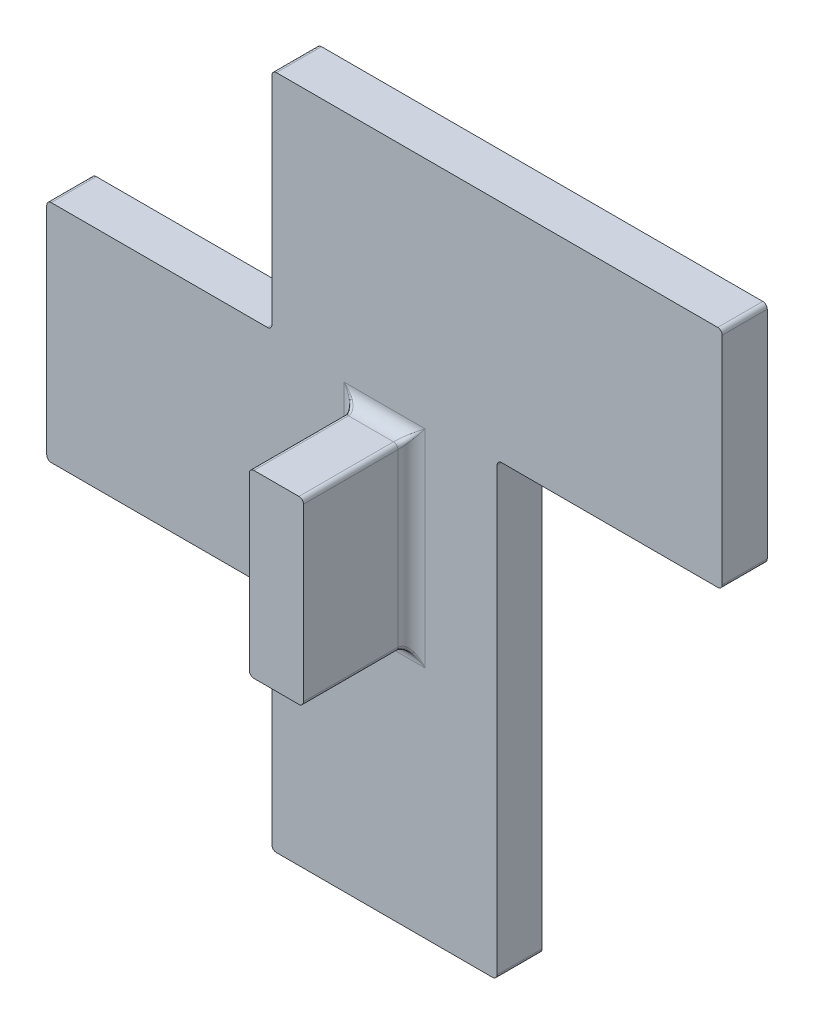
ISO-10303-21;
HEADER;
FILE_DESCRIPTION(('STEP AP214'),'2;1');
FILE_NAME('part.step','',(''),(''),'','','');
FILE_SCHEMA(('AUTOMOTIVE_DESIGN { 1 0 10303 214 1 1 1 1 }'));
ENDSEC;
DATA;
#1=APPLICATION_CONTEXT('core data for automotive mechanical design processes');
#2=APPLICATION_PROTOCOL_DEFINITION('international standard','automotive_design',2000,#1);
#3=PRODUCT_CONTEXT('',#1,'mechanical');
#4=PRODUCT('Part','Part','',(#3));
#5=PRODUCT_RELATED_PRODUCT_CATEGORY('part','',(#4));
#6=PRODUCT_DEFINITION_FORMATION('','',#4);
#7=PRODUCT_DEFINITION_CONTEXT('part definition',#1,'design');
#8=PRODUCT_DEFINITION('design','',#6,#7);
#9=PRODUCT_DEFINITION_SHAPE('','',#8);
#10=(LENGTH_UNIT() NAMED_UNIT(*) SI_UNIT(.MILLI.,.METRE.));
#11=(NAMED_UNIT(*) PLANE_ANGLE_UNIT() SI_UNIT($,.RADIAN.));
#12=(NAMED_UNIT(*) SI_UNIT($,.STERADIAN.) SOLID_ANGLE_UNIT());
#13=UNCERTAINTY_MEASURE_WITH_UNIT(LENGTH_MEASURE(1.E-05),#10,'distance_accuracy_value','');
#14=(GEOMETRIC_REPRESENTATION_CONTEXT(3) GLOBAL_UNCERTAINTY_ASSIGNED_CONTEXT((#13)) GLOBAL_UNIT_ASSIGNED_CONTEXT((#10,
#11,#12)) REPRESENTATION_CONTEXT('',''));
#15=CARTESIAN_POINT('',(0.,0.,0.));
#16=DIRECTION('',(0.,0.,1.));
#17=DIRECTION('',(1.,0.,0.));
#18=AXIS2_PLACEMENT_3D('',#15,#16,#17);
#19=CARTESIAN_POINT('',(0.,0.,5.));
#20=DIRECTION('',(0.,0.,-1.));
#21=DIRECTION('',(-1.,0.,0.));
#22=AXIS2_PLACEMENT_3D('',#19,#20,#21);
#23=PLANE('',#22);
#24=DIRECTION('',(0.,-1.,0.));
#25=VECTOR('',#24,1.);
#26=CARTESIAN_POINT('',(8.,47.5,5.));
#27=LINE('',#26,#25);
#28=CARTESIAN_POINT('',(8.00000000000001,26.,5.));
#29=VERTEX_POINT('',#28);
#30=CARTESIAN_POINT('',(8.,49.,5.));
#31=VERTEX_POINT('',#30);
#32=EDGE_CURVE('E441',#29,#31,#27,.F.);
#33=ORIENTED_EDGE('',*,*,#32,.T.);
#34=DIRECTION('',(-1.,0.,0.));
#35=VECTOR('',#34,1.);
#36=CARTESIAN_POINT('',(15.5,49.,5.));
#37=LINE('',#36,#35);
#38=CARTESIAN_POINT('',(17.,49.,5.));
#39=VERTEX_POINT('',#38);
#40=EDGE_CURVE('E445',#31,#39,#37,.F.);
#41=ORIENTED_EDGE('',*,*,#40,.T.);
#42=DIRECTION('',(0.,1.,0.));
#43=VECTOR('',#42,1.);
#44=CARTESIAN_POINT('',(17.,27.5,5.));
#45=LINE('',#44,#43);
#46=CARTESIAN_POINT('',(17.,26.,5.));
#47=VERTEX_POINT('',#46);
#48=EDGE_CURVE('E433',#39,#47,#45,.F.);
#49=ORIENTED_EDGE('',*,*,#48,.T.);
#50=DIRECTION('',(1.,0.,0.));
#51=VECTOR('',#50,1.);
#52=CARTESIAN_POINT('',(9.50000000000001,26.,5.));
#53=LINE('',#52,#51);
#54=EDGE_CURVE('E437',#47,#29,#53,.F.);
#55=ORIENTED_EDGE('',*,*,#54,.T.);
#56=EDGE_LOOP('',(#33,#41,#49,#55));
#57=FACE_BOUND('',#56,.T.);
#58=DIRECTION('',(1.,0.,0.));
#59=VECTOR('',#58,1.);
#60=CARTESIAN_POINT('',(50.,50.,5.));
#61=LINE('',#60,#59);
#62=CARTESIAN_POINT('',(25.5,50.,5.));
#63=VERTEX_POINT('',#62);
#64=CARTESIAN_POINT('',(49.5,50.,5.));
#65=VERTEX_POINT('',#64);
#66=EDGE_CURVE('E639',#63,#65,#61,.T.);
#67=ORIENTED_EDGE('',*,*,#66,.T.);
#68=CARTESIAN_POINT('',(49.5,50.5,5.));
#69=DIRECTION('',(0.,0.,-1.));
#70=DIRECTION('',(-1.,0.,0.));
#71=AXIS2_PLACEMENT_3D('',#68,#69,#70);
#72=CIRCLE('',#71,0.5);
#73=CARTESIAN_POINT('',(50.,50.5,5.));
#74=VERTEX_POINT('',#73);
#75=EDGE_CURVE('E352',#65,#74,#72,.F.);
#76=ORIENTED_EDGE('',*,*,#75,.T.);
#77=DIRECTION('',(0.,1.,0.));
#78=VECTOR('',#77,1.);
#79=CARTESIAN_POINT('',(50.,75.,5.));
#80=LINE('',#79,#78);
#81=CARTESIAN_POINT('',(50.,74.5,5.));
#82=VERTEX_POINT('',#81);
#83=EDGE_CURVE('E270',#74,#82,#80,.T.);
#84=ORIENTED_EDGE('',*,*,#83,.T.);
#85=CARTESIAN_POINT('',(49.5,74.5,5.));
#86=DIRECTION('',(0.,0.,-1.));
#87=DIRECTION('',(-1.,0.,0.));
#88=AXIS2_PLACEMENT_3D('',#85,#86,#87);
#89=CIRCLE('',#88,0.5);
#90=CARTESIAN_POINT('',(49.5,75.,5.));
#91=VERTEX_POINT('',#90);
#92=EDGE_CURVE('E346',#82,#91,#89,.F.);
#93=ORIENTED_EDGE('',*,*,#92,.T.);
#94=DIRECTION('',(-1.,0.,0.));
#95=VECTOR('',#94,1.);
#96=CARTESIAN_POINT('',(0.,75.,5.));
#97=LINE('',#96,#95);
#98=CARTESIAN_POINT('',(0.5,75.,5.));
#99=VERTEX_POINT('',#98);
#100=EDGE_CURVE('E645',#91,#99,#97,.T.);
#101=ORIENTED_EDGE('',*,*,#100,.T.);
#102=CARTESIAN_POINT('',(0.5,74.5,5.));
#103=DIRECTION('',(0.,0.,-1.));
#104=DIRECTION('',(-1.,0.,0.));
#105=AXIS2_PLACEMENT_3D('',#102,#103,#104);
#106=CIRCLE('',#105,0.5);
#107=CARTESIAN_POINT('',(0.,74.5,5.));
#108=VERTEX_POINT('',#107);
#109=EDGE_CURVE('E337',#99,#108,#106,.F.);
#110=ORIENTED_EDGE('',*,*,#109,.T.);
#111=DIRECTION('',(0.,-1.,0.));
#112=VECTOR('',#111,1.);
#113=CARTESIAN_POINT('',(0.,50.,5.));
#114=LINE('',#113,#112);
#115=CARTESIAN_POINT('',(0.,50.5,5.));
#116=VERTEX_POINT('',#115);
#117=EDGE_CURVE('E649',#108,#116,#114,.T.);
#118=ORIENTED_EDGE('',*,*,#117,.T.);
#119=CARTESIAN_POINT('',(-0.5,50.5,5.));
#120=DIRECTION('',(0.,0.,-1.));
#121=DIRECTION('',(-1.,0.,0.));
#122=AXIS2_PLACEMENT_3D('',#119,#120,#121);
#123=CIRCLE('',#122,0.5);
#124=CARTESIAN_POINT('',(-0.5,50.,5.));
#125=VERTEX_POINT('',#124);
#126=EDGE_CURVE('E426',#116,#125,#123,.T.);
#127=ORIENTED_EDGE('',*,*,#126,.T.);
#128=DIRECTION('',(-1.,0.,0.));
#129=VECTOR('',#128,1.);
#130=CARTESIAN_POINT('',(-25.,50.,5.));
#131=LINE('',#130,#129);
#132=CARTESIAN_POINT('',(-24.5,50.,5.));
#133=VERTEX_POINT('',#132);
#134=EDGE_CURVE('E653',#125,#133,#131,.T.);
#135=ORIENTED_EDGE('',*,*,#134,.T.);
#136=CARTESIAN_POINT('',(-24.5,49.5,5.));
#137=DIRECTION('',(0.,0.,-1.));
#138=DIRECTION('',(-1.,0.,0.));
#139=AXIS2_PLACEMENT_3D('',#136,#137,#138);
#140=CIRCLE('',#139,0.5);
#141=CARTESIAN_POINT('',(-25.,49.5,5.));
#142=VERTEX_POINT('',#141);
#143=EDGE_CURVE('E334',#133,#142,#140,.F.);
#144=ORIENTED_EDGE('',*,*,#143,.T.);
#145=DIRECTION('',(0.,-1.,0.));
#146=VECTOR('',#145,1.);
#147=CARTESIAN_POINT('',(-25.,25.,5.));
#148=LINE('',#147,#146);
#149=CARTESIAN_POINT('',(-25.,25.5,5.));
#150=VERTEX_POINT('',#149);
#151=EDGE_CURVE('E657',#142,#150,#148,.T.);
#152=ORIENTED_EDGE('',*,*,#151,.T.);
#153=CARTESIAN_POINT('',(-24.5,25.5,5.));
#154=DIRECTION('',(0.,0.,-1.));
#155=DIRECTION('',(-1.,0.,0.));
#156=AXIS2_PLACEMENT_3D('',#153,#154,#155);
#157=CIRCLE('',#156,0.5);
#158=CARTESIAN_POINT('',(-24.5,25.,5.));
#159=VERTEX_POINT('',#158);
#160=EDGE_CURVE('E340',#150,#159,#157,.F.);
#161=ORIENTED_EDGE('',*,*,#160,.T.);
#162=DIRECTION('',(1.,0.,0.));
#163=VECTOR('',#162,1.);
#164=CARTESIAN_POINT('',(0.,25.,5.));
#165=LINE('',#164,#163);
#166=CARTESIAN_POINT('',(-0.5,25.,5.));
#167=VERTEX_POINT('',#166);
#168=EDGE_CURVE('E661',#159,#167,#165,.T.);
#169=ORIENTED_EDGE('',*,*,#168,.T.);
#170=CARTESIAN_POINT('',(-0.5,24.5,5.));
#171=DIRECTION('',(0.,0.,-1.));
#172=DIRECTION('',(-1.,0.,0.));
#173=AXIS2_PLACEMENT_3D('',#170,#171,#172);
#174=CIRCLE('',#173,0.5);
#175=CARTESIAN_POINT('',(0.,24.5,5.));
#176=VERTEX_POINT('',#175);
#177=EDGE_CURVE('E420',#167,#176,#174,.T.);
#178=ORIENTED_EDGE('',*,*,#177,.T.);
#179=DIRECTION('',(0.,-1.,0.));
#180=VECTOR('',#179,1.);
#181=CARTESIAN_POINT('',(0.,0.,5.));
#182=LINE('',#181,#180);
#183=CARTESIAN_POINT('',(0.,0.5,5.));
#184=VERTEX_POINT('',#183);
#185=EDGE_CURVE('E312',#176,#184,#182,.T.);
#186=ORIENTED_EDGE('',*,*,#185,.T.);
#187=CARTESIAN_POINT('',(0.5,0.5,5.));
#188=DIRECTION('',(0.,0.,-1.));
#189=DIRECTION('',(-1.,0.,0.));
#190=AXIS2_PLACEMENT_3D('',#187,#188,#189);
#191=CIRCLE('',#190,0.5);
#192=CARTESIAN_POINT('',(0.5,0.,5.));
#193=VERTEX_POINT('',#192);
#194=EDGE_CURVE('E343',#184,#193,#191,.F.);
#195=ORIENTED_EDGE('',*,*,#194,.T.);
#196=DIRECTION('',(1.,0.,0.));
#197=VECTOR('',#196,1.);
#198=CARTESIAN_POINT('',(25.,0.,5.));
#199=LINE('',#198,#197);
#200=CARTESIAN_POINT('',(24.5,0.,5.));
#201=VERTEX_POINT('',#200);
#202=EDGE_CURVE('E310',#193,#201,#199,.T.);
#203=ORIENTED_EDGE('',*,*,#202,.T.);
#204=CARTESIAN_POINT('',(24.5,0.5,5.));
#205=DIRECTION('',(0.,0.,-1.));
#206=DIRECTION('',(-1.,0.,0.));
#207=AXIS2_PLACEMENT_3D('',#204,#205,#206);
#208=CIRCLE('',#207,0.5);
#209=CARTESIAN_POINT('',(25.,0.5,5.));
#210=VERTEX_POINT('',#209);
#211=EDGE_CURVE('E349',#201,#210,#208,.F.);
#212=ORIENTED_EDGE('',*,*,#211,.T.);
#213=DIRECTION('',(0.,1.,0.));
#214=VECTOR('',#213,1.);
#215=CARTESIAN_POINT('',(25.,50.,5.));
#216=LINE('',#215,#214);
#217=CARTESIAN_POINT('',(25.,49.5,5.));
#218=VERTEX_POINT('',#217);
#219=EDGE_CURVE('E635',#210,#218,#216,.T.);
#220=ORIENTED_EDGE('',*,*,#219,.T.);
#221=CARTESIAN_POINT('',(25.5,49.5,5.));
#222=DIRECTION('',(0.,0.,-1.));
#223=DIRECTION('',(-1.,0.,0.));
#224=AXIS2_PLACEMENT_3D('',#221,#222,#223);
#225=CIRCLE('',#224,0.5);
#226=EDGE_CURVE('E414',#218,#63,#225,.T.);
#227=ORIENTED_EDGE('',*,*,#226,.T.);
#228=EDGE_LOOP('',(#67,#76,#84,#93,#101,#110,#118,#127,#135,#144,#152,#161,#169,#178,#186,#195,
#203,#212,#220,#227));
#229=FACE_BOUND('',#228,.T.);
#230=ADVANCED_FACE('F49',(#57,#229),#23,.F.);
#231=CARTESIAN_POINT('',(25.,0.,5.));
#232=DIRECTION('',(0.,1.,0.));
#233=DIRECTION('',(-1.,0.,0.));
#234=AXIS2_PLACEMENT_3D('',#231,#232,#233);
#235=PLANE('',#234);
#236=DIRECTION('',(1.,0.,0.));
#237=VECTOR('',#236,1.);
#238=CARTESIAN_POINT('',(25.,0.,0.));
#239=LINE('',#238,#237);
#240=CARTESIAN_POINT('',(0.5,0.,0.));
#241=VERTEX_POINT('',#240);
#242=CARTESIAN_POINT('',(24.5,0.,0.));
#243=VERTEX_POINT('',#242);
#244=EDGE_CURVE('E631',#241,#243,#239,.T.);
#245=ORIENTED_EDGE('',*,*,#244,.T.);
#246=DIRECTION('',(0.,0.,-1.));
#247=VECTOR('',#246,1.);
#248=CARTESIAN_POINT('',(24.5,0.,5.));
#249=LINE('',#248,#247);
#250=EDGE_CURVE('E366',#243,#201,#249,.F.);
#251=ORIENTED_EDGE('',*,*,#250,.T.);
#252=ORIENTED_EDGE('',*,*,#202,.F.);
#253=DIRECTION('',(0.,0.,-1.));
#254=VECTOR('',#253,1.);
#255=CARTESIAN_POINT('',(0.5,0.,5.));
#256=LINE('',#255,#254);
#257=EDGE_CURVE('E362',#193,#241,#256,.T.);
#258=ORIENTED_EDGE('',*,*,#257,.T.);
#259=EDGE_LOOP('',(#245,#251,#252,#258));
#260=FACE_BOUND('',#259,.T.);
#261=ADVANCED_FACE('F693',(#260),#235,.F.);
#262=CARTESIAN_POINT('',(25.,50.,5.));
#263=DIRECTION('',(-1.,0.,0.));
#264=DIRECTION('',(0.,-1.,0.));
#265=AXIS2_PLACEMENT_3D('',#262,#263,#264);
#266=PLANE('',#265);
#267=DIRECTION('',(0.,1.,0.));
#268=VECTOR('',#267,1.);
#269=CARTESIAN_POINT('',(25.,50.,0.));
#270=LINE('',#269,#268);
#271=CARTESIAN_POINT('',(25.,0.5,0.));
#272=VERTEX_POINT('',#271);
#273=CARTESIAN_POINT('',(25.,49.5,0.));
#274=VERTEX_POINT('',#273);
#275=EDGE_CURVE('E287',#272,#274,#270,.T.);
#276=ORIENTED_EDGE('',*,*,#275,.T.);
#277=DIRECTION('',(0.,0.,-1.));
#278=VECTOR('',#277,1.);
#279=CARTESIAN_POINT('',(25.,49.5,5.));
#280=LINE('',#279,#278);
#281=EDGE_CURVE('E359',#274,#218,#280,.F.);
#282=ORIENTED_EDGE('',*,*,#281,.T.);
#283=ORIENTED_EDGE('',*,*,#219,.F.);
#284=DIRECTION('',(0.,0.,-1.));
#285=VECTOR('',#284,1.);
#286=CARTESIAN_POINT('',(25.,0.5,5.));
#287=LINE('',#286,#285);
#288=EDGE_CURVE('E355',#210,#272,#287,.T.);
#289=ORIENTED_EDGE('',*,*,#288,.T.);
#290=EDGE_LOOP('',(#276,#282,#283,#289));
#291=FACE_BOUND('',#290,.T.);
#292=ADVANCED_FACE('F675',(#291),#266,.F.);
#293=CARTESIAN_POINT('',(50.,50.,5.));
#294=DIRECTION('',(0.,1.,0.));
#295=DIRECTION('',(-1.,0.,0.));
#296=AXIS2_PLACEMENT_3D('',#293,#294,#295);
#297=PLANE('',#296);
#298=DIRECTION('',(1.,0.,0.));
#299=VECTOR('',#298,1.);
#300=CARTESIAN_POINT('',(50.,50.,0.));
#301=LINE('',#300,#299);
#302=CARTESIAN_POINT('',(25.5,50.,0.));
#303=VERTEX_POINT('',#302);
#304=CARTESIAN_POINT('',(49.5,50.,0.));
#305=VERTEX_POINT('',#304);
#306=EDGE_CURVE('E280',#303,#305,#301,.T.);
#307=ORIENTED_EDGE('',*,*,#306,.T.);
#308=DIRECTION('',(0.,0.,-1.));
#309=VECTOR('',#308,1.);
#310=CARTESIAN_POINT('',(49.5,50.,5.));
#311=LINE('',#310,#309);
#312=EDGE_CURVE('E254',#305,#65,#311,.F.);
#313=ORIENTED_EDGE('',*,*,#312,.T.);
#314=ORIENTED_EDGE('',*,*,#66,.F.);
#315=DIRECTION('',(0.,0.,-1.));
#316=VECTOR('',#315,1.);
#317=CARTESIAN_POINT('',(25.5,50.,0.));
#318=LINE('',#317,#316);
#319=EDGE_CURVE('E260',#63,#303,#318,.T.);
#320=ORIENTED_EDGE('',*,*,#319,.T.);
#321=EDGE_LOOP('',(#307,#313,#314,#320));
#322=FACE_BOUND('',#321,.T.);
#323=ADVANCED_FACE('F684',(#322),#297,.F.);
#324=CARTESIAN_POINT('',(50.,75.,5.));
#325=DIRECTION('',(-1.,0.,0.));
#326=DIRECTION('',(0.,-1.,0.));
#327=AXIS2_PLACEMENT_3D('',#324,#325,#326);
#328=PLANE('',#327);
#329=ORIENTED_EDGE('',*,*,#83,.F.);
#330=DIRECTION('',(0.,0.,-1.));
#331=VECTOR('',#330,1.);
#332=CARTESIAN_POINT('',(50.,50.5,5.));
#333=LINE('',#332,#331);
#334=CARTESIAN_POINT('',(50.,50.5,0.));
#335=VERTEX_POINT('',#334);
#336=EDGE_CURVE('E253',#74,#335,#333,.T.);
#337=ORIENTED_EDGE('',*,*,#336,.T.);
#338=DIRECTION('',(0.,1.,0.));
#339=VECTOR('',#338,1.);
#340=CARTESIAN_POINT('',(50.,75.,0.));
#341=LINE('',#340,#339);
#342=CARTESIAN_POINT('',(50.,74.5,0.));
#343=VERTEX_POINT('',#342);
#344=EDGE_CURVE('E267',#335,#343,#341,.T.);
#345=ORIENTED_EDGE('',*,*,#344,.T.);
#346=DIRECTION('',(0.,0.,-1.));
#347=VECTOR('',#346,1.);
#348=CARTESIAN_POINT('',(50.,74.5,5.));
#349=LINE('',#348,#347);
#350=EDGE_CURVE('E273',#343,#82,#349,.F.);
#351=ORIENTED_EDGE('',*,*,#350,.T.);
#352=EDGE_LOOP('',(#329,#337,#345,#351));
#353=FACE_BOUND('',#352,.T.);
#354=ADVANCED_FACE('F266',(#353),#328,.F.);
#355=CARTESIAN_POINT('',(0.,75.,5.));
#356=DIRECTION('',(0.,-1.,0.));
#357=DIRECTION('',(0.,0.,-1.));
#358=AXIS2_PLACEMENT_3D('',#355,#356,#357);
#359=PLANE('',#358);
#360=ORIENTED_EDGE('',*,*,#100,.F.);
#361=DIRECTION('',(0.,0.,-1.));
#362=VECTOR('',#361,1.);
#363=CARTESIAN_POINT('',(49.5,75.,5.));
#364=LINE('',#363,#362);
#365=CARTESIAN_POINT('',(49.5,75.,0.));
#366=VERTEX_POINT('',#365);
#367=EDGE_CURVE('E386',#91,#366,#364,.T.);
#368=ORIENTED_EDGE('',*,*,#367,.T.);
#369=DIRECTION('',(-1.,0.,0.));
#370=VECTOR('',#369,1.);
#371=CARTESIAN_POINT('',(0.,75.,0.));
#372=LINE('',#371,#370);
#373=CARTESIAN_POINT('',(0.5,75.,0.));
#374=VERTEX_POINT('',#373);
#375=EDGE_CURVE('E279',#366,#374,#372,.T.);
#376=ORIENTED_EDGE('',*,*,#375,.T.);
#377=DIRECTION('',(0.,0.,-1.));
#378=VECTOR('',#377,1.);
#379=CARTESIAN_POINT('',(0.5,75.,5.));
#380=LINE('',#379,#378);
#381=EDGE_CURVE('E383',#374,#99,#380,.F.);
#382=ORIENTED_EDGE('',*,*,#381,.T.);
#383=EDGE_LOOP('',(#360,#368,#376,#382));
#384=FACE_BOUND('',#383,.T.);
#385=ADVANCED_FACE('F691',(#384),#359,.F.);
#386=CARTESIAN_POINT('',(0.,50.,5.));
#387=DIRECTION('',(1.,0.,0.));
#388=DIRECTION('',(0.,0.,-1.));
#389=AXIS2_PLACEMENT_3D('',#386,#387,#388);
#390=PLANE('',#389);
#391=ORIENTED_EDGE('',*,*,#117,.F.);
#392=DIRECTION('',(0.,0.,-1.));
#393=VECTOR('',#392,1.);
#394=CARTESIAN_POINT('',(0.,74.5,5.));
#395=LINE('',#394,#393);
#396=CARTESIAN_POINT('',(0.,74.5,0.));
#397=VERTEX_POINT('',#396);
#398=EDGE_CURVE('E400',#108,#397,#395,.T.);
#399=ORIENTED_EDGE('',*,*,#398,.T.);
#400=DIRECTION('',(0.,-1.,0.));
#401=VECTOR('',#400,1.);
#402=CARTESIAN_POINT('',(0.,50.,0.));
#403=LINE('',#402,#401);
#404=CARTESIAN_POINT('',(0.,50.5,0.));
#405=VERTEX_POINT('',#404);
#406=EDGE_CURVE('E285',#397,#405,#403,.T.);
#407=ORIENTED_EDGE('',*,*,#406,.T.);
#408=DIRECTION('',(0.,0.,-1.));
#409=VECTOR('',#408,1.);
#410=CARTESIAN_POINT('',(0.,50.5,5.));
#411=LINE('',#410,#409);
#412=EDGE_CURVE('E397',#405,#116,#411,.F.);
#413=ORIENTED_EDGE('',*,*,#412,.T.);
#414=EDGE_LOOP('',(#391,#399,#407,#413));
#415=FACE_BOUND('',#414,.T.);
#416=ADVANCED_FACE('F724',(#415),#390,.F.);
#417=CARTESIAN_POINT('',(-25.,50.,5.));
#418=DIRECTION('',(0.,-1.,0.));
#419=DIRECTION('',(0.,0.,-1.));
#420=AXIS2_PLACEMENT_3D('',#417,#418,#419);
#421=PLANE('',#420);
#422=ORIENTED_EDGE('',*,*,#134,.F.);
#423=DIRECTION('',(0.,0.,-1.));
#424=VECTOR('',#423,1.);
#425=CARTESIAN_POINT('',(-0.5,50.,0.));
#426=LINE('',#425,#424);
#427=CARTESIAN_POINT('',(-0.5,50.,0.));
#428=VERTEX_POINT('',#427);
#429=EDGE_CURVE('E407',#125,#428,#426,.T.);
#430=ORIENTED_EDGE('',*,*,#429,.T.);
#431=DIRECTION('',(-1.,0.,0.));
#432=VECTOR('',#431,1.);
#433=CARTESIAN_POINT('',(-25.,50.,0.));
#434=LINE('',#433,#432);
#435=CARTESIAN_POINT('',(-24.5,50.,0.));
#436=VERTEX_POINT('',#435);
#437=EDGE_CURVE('E294',#428,#436,#434,.T.);
#438=ORIENTED_EDGE('',*,*,#437,.T.);
#439=DIRECTION('',(0.,0.,-1.));
#440=VECTOR('',#439,1.);
#441=CARTESIAN_POINT('',(-24.5,50.,5.));
#442=LINE('',#441,#440);
#443=EDGE_CURVE('E404',#436,#133,#442,.F.);
#444=ORIENTED_EDGE('',*,*,#443,.T.);
#445=EDGE_LOOP('',(#422,#430,#438,#444));
#446=FACE_BOUND('',#445,.T.);
#447=ADVANCED_FACE('F720',(#446),#421,.F.);
#448=CARTESIAN_POINT('',(-25.,25.,5.));
#449=DIRECTION('',(1.,0.,0.));
#450=DIRECTION('',(0.,0.,-1.));
#451=AXIS2_PLACEMENT_3D('',#448,#449,#450);
#452=PLANE('',#451);
#453=DIRECTION('',(0.,-1.,0.));
#454=VECTOR('',#453,1.);
#455=CARTESIAN_POINT('',(-25.,25.,0.));
#456=LINE('',#455,#454);
#457=CARTESIAN_POINT('',(-25.,49.5,0.));
#458=VERTEX_POINT('',#457);
#459=CARTESIAN_POINT('',(-25.,25.5,0.));
#460=VERTEX_POINT('',#459);
#461=EDGE_CURVE('E298',#458,#460,#456,.T.);
#462=ORIENTED_EDGE('',*,*,#461,.T.);
#463=DIRECTION('',(0.,0.,-1.));
#464=VECTOR('',#463,1.);
#465=CARTESIAN_POINT('',(-25.,25.5,5.));
#466=LINE('',#465,#464);
#467=EDGE_CURVE('E394',#460,#150,#466,.F.);
#468=ORIENTED_EDGE('',*,*,#467,.T.);
#469=ORIENTED_EDGE('',*,*,#151,.F.);
#470=DIRECTION('',(0.,0.,-1.));
#471=VECTOR('',#470,1.);
#472=CARTESIAN_POINT('',(-25.,49.5,5.));
#473=LINE('',#472,#471);
#474=EDGE_CURVE('E390',#142,#458,#473,.T.);
#475=ORIENTED_EDGE('',*,*,#474,.T.);
#476=EDGE_LOOP('',(#462,#468,#469,#475));
#477=FACE_BOUND('',#476,.T.);
#478=ADVANCED_FACE('F716',(#477),#452,.F.);
#479=CARTESIAN_POINT('',(0.,25.,5.));
#480=DIRECTION('',(0.,1.,0.));
#481=DIRECTION('',(-1.,0.,0.));
#482=AXIS2_PLACEMENT_3D('',#479,#480,#481);
#483=PLANE('',#482);
#484=DIRECTION('',(1.,0.,0.));
#485=VECTOR('',#484,1.);
#486=CARTESIAN_POINT('',(0.,25.,0.));
#487=LINE('',#486,#485);
#488=CARTESIAN_POINT('',(-24.5,25.,0.));
#489=VERTEX_POINT('',#488);
#490=CARTESIAN_POINT('',(-0.5,25.,0.));
#491=VERTEX_POINT('',#490);
#492=EDGE_CURVE('E302',#489,#491,#487,.T.);
#493=ORIENTED_EDGE('',*,*,#492,.T.);
#494=DIRECTION('',(0.,0.,-1.));
#495=VECTOR('',#494,1.);
#496=CARTESIAN_POINT('',(-0.5,25.,5.));
#497=LINE('',#496,#495);
#498=EDGE_CURVE('E380',#491,#167,#497,.F.);
#499=ORIENTED_EDGE('',*,*,#498,.T.);
#500=ORIENTED_EDGE('',*,*,#168,.F.);
#501=DIRECTION('',(0.,0.,-1.));
#502=VECTOR('',#501,1.);
#503=CARTESIAN_POINT('',(-24.5,25.,5.));
#504=LINE('',#503,#502);
#505=EDGE_CURVE('E376',#159,#489,#504,.T.);
#506=ORIENTED_EDGE('',*,*,#505,.T.);
#507=EDGE_LOOP('',(#493,#499,#500,#506));
#508=FACE_BOUND('',#507,.T.);
#509=ADVANCED_FACE('F712',(#508),#483,.F.);
#510=CARTESIAN_POINT('',(0.,0.,5.));
#511=DIRECTION('',(1.,0.,0.));
#512=DIRECTION('',(0.,0.,-1.));
#513=AXIS2_PLACEMENT_3D('',#510,#511,#512);
#514=PLANE('',#513);
#515=ORIENTED_EDGE('',*,*,#185,.F.);
#516=DIRECTION('',(0.,0.,-1.));
#517=VECTOR('',#516,1.);
#518=CARTESIAN_POINT('',(0.,24.5,0.));
#519=LINE('',#518,#517);
#520=CARTESIAN_POINT('',(0.,24.5,0.));
#521=VERTEX_POINT('',#520);
#522=EDGE_CURVE('E372',#176,#521,#519,.T.);
#523=ORIENTED_EDGE('',*,*,#522,.T.);
#524=DIRECTION('',(0.,-1.,0.));
#525=VECTOR('',#524,1.);
#526=CARTESIAN_POINT('',(0.,0.,0.));
#527=LINE('',#526,#525);
#528=CARTESIAN_POINT('',(0.,0.5,0.));
#529=VERTEX_POINT('',#528);
#530=EDGE_CURVE('E306',#521,#529,#527,.T.);
#531=ORIENTED_EDGE('',*,*,#530,.T.);
#532=DIRECTION('',(0.,0.,-1.));
#533=VECTOR('',#532,1.);
#534=CARTESIAN_POINT('',(0.,0.5,5.));
#535=LINE('',#534,#533);
#536=EDGE_CURVE('E369',#529,#184,#535,.F.);
#537=ORIENTED_EDGE('',*,*,#536,.T.);
#538=EDGE_LOOP('',(#515,#523,#531,#537));
#539=FACE_BOUND('',#538,.T.);
#540=ADVANCED_FACE('F709',(#539),#514,.F.);
#541=CARTESIAN_POINT('',(0.,0.,0.));
#542=DIRECTION('',(0.,0.,-1.));
#543=DIRECTION('',(-1.,0.,0.));
#544=AXIS2_PLACEMENT_3D('',#541,#542,#543);
#545=PLANE('',#544);
#546=ORIENTED_EDGE('',*,*,#344,.F.);
#547=CARTESIAN_POINT('',(49.5,50.5,0.));
#548=DIRECTION('',(0.,0.,-1.));
#549=DIRECTION('',(-1.,0.,0.));
#550=AXIS2_PLACEMENT_3D('',#547,#548,#549);
#551=CIRCLE('',#550,0.5);
#552=EDGE_CURVE('E249',#335,#305,#551,.T.);
#553=ORIENTED_EDGE('',*,*,#552,.T.);
#554=ORIENTED_EDGE('',*,*,#306,.F.);
#555=CARTESIAN_POINT('',(25.5,49.5,0.));
#556=DIRECTION('',(0.,0.,-1.));
#557=DIRECTION('',(-1.,0.,0.));
#558=AXIS2_PLACEMENT_3D('',#555,#556,#557);
#559=CIRCLE('',#558,0.5);
#560=EDGE_CURVE('E411',#303,#274,#559,.F.);
#561=ORIENTED_EDGE('',*,*,#560,.T.);
#562=ORIENTED_EDGE('',*,*,#275,.F.);
#563=CARTESIAN_POINT('',(24.5,0.5,0.));
#564=DIRECTION('',(0.,0.,-1.));
#565=DIRECTION('',(-1.,0.,0.));
#566=AXIS2_PLACEMENT_3D('',#563,#564,#565);
#567=CIRCLE('',#566,0.5);
#568=EDGE_CURVE('E261',#272,#243,#567,.T.);
#569=ORIENTED_EDGE('',*,*,#568,.T.);
#570=ORIENTED_EDGE('',*,*,#244,.F.);
#571=CARTESIAN_POINT('',(0.5,0.5,0.));
#572=DIRECTION('',(0.,0.,-1.));
#573=DIRECTION('',(-1.,0.,0.));
#574=AXIS2_PLACEMENT_3D('',#571,#572,#573);
#575=CIRCLE('',#574,0.5);
#576=EDGE_CURVE('E322',#241,#529,#575,.T.);
#577=ORIENTED_EDGE('',*,*,#576,.T.);
#578=ORIENTED_EDGE('',*,*,#530,.F.);
#579=CARTESIAN_POINT('',(-0.5,24.5,0.));
#580=DIRECTION('',(0.,0.,-1.));
#581=DIRECTION('',(-1.,0.,0.));
#582=AXIS2_PLACEMENT_3D('',#579,#580,#581);
#583=CIRCLE('',#582,0.5);
#584=EDGE_CURVE('E417',#521,#491,#583,.F.);
#585=ORIENTED_EDGE('',*,*,#584,.T.);
#586=ORIENTED_EDGE('',*,*,#492,.F.);
#587=CARTESIAN_POINT('',(-24.5,25.5,0.));
#588=DIRECTION('',(0.,0.,-1.));
#589=DIRECTION('',(-1.,0.,0.));
#590=AXIS2_PLACEMENT_3D('',#587,#588,#589);
#591=CIRCLE('',#590,0.5);
#592=EDGE_CURVE('E319',#489,#460,#591,.T.);
#593=ORIENTED_EDGE('',*,*,#592,.T.);
#594=ORIENTED_EDGE('',*,*,#461,.F.);
#595=CARTESIAN_POINT('',(-24.5,49.5,0.));
#596=DIRECTION('',(0.,0.,-1.));
#597=DIRECTION('',(-1.,0.,0.));
#598=AXIS2_PLACEMENT_3D('',#595,#596,#597);
#599=CIRCLE('',#598,0.5);
#600=EDGE_CURVE('E272',#458,#436,#599,.T.);
#601=ORIENTED_EDGE('',*,*,#600,.T.);
#602=ORIENTED_EDGE('',*,*,#437,.F.);
#603=CARTESIAN_POINT('',(-0.5,50.5,0.));
#604=DIRECTION('',(0.,0.,-1.));
#605=DIRECTION('',(-1.,0.,0.));
#606=AXIS2_PLACEMENT_3D('',#603,#604,#605);
#607=CIRCLE('',#606,0.5);
#608=EDGE_CURVE('E423',#428,#405,#607,.F.);
#609=ORIENTED_EDGE('',*,*,#608,.T.);
#610=ORIENTED_EDGE('',*,*,#406,.F.);
#611=CARTESIAN_POINT('',(0.5,74.5,0.));
#612=DIRECTION('',(0.,0.,-1.));
#613=DIRECTION('',(-1.,0.,0.));
#614=AXIS2_PLACEMENT_3D('',#611,#612,#613);
#615=CIRCLE('',#614,0.5);
#616=EDGE_CURVE('E316',#397,#374,#615,.T.);
#617=ORIENTED_EDGE('',*,*,#616,.T.);
#618=ORIENTED_EDGE('',*,*,#375,.F.);
#619=CARTESIAN_POINT('',(49.5,74.5,0.));
#620=DIRECTION('',(0.,0.,-1.));
#621=DIRECTION('',(-1.,0.,0.));
#622=AXIS2_PLACEMENT_3D('',#619,#620,#621);
#623=CIRCLE('',#622,0.5);
#624=EDGE_CURVE('E277',#366,#343,#623,.T.);
#625=ORIENTED_EDGE('',*,*,#624,.T.);
#626=EDGE_LOOP('',(#546,#553,#554,#561,#562,#569,#570,#577,#578,#585,#586,#593,#594,#601,#602,
#609,#610,#617,#618,#625));
#627=FACE_BOUND('',#626,.T.);
#628=ADVANCED_FACE('F275',(#627),#545,.T.);
#629=CARTESIAN_POINT('',(49.5,50.5,5.));
#630=DIRECTION('',(0.,0.,-1.));
#631=DIRECTION('',(-1.,0.,0.));
#632=AXIS2_PLACEMENT_3D('',#629,#630,#631);
#633=CYLINDRICAL_SURFACE('',#632,0.5);
#634=ORIENTED_EDGE('',*,*,#75,.F.);
#635=ORIENTED_EDGE('',*,*,#312,.F.);
#636=ORIENTED_EDGE('',*,*,#552,.F.);
#637=ORIENTED_EDGE('',*,*,#336,.F.);
#638=EDGE_LOOP('',(#634,#635,#636,#637));
#639=FACE_BOUND('',#638,.T.);
#640=ADVANCED_FACE('F252',(#639),#633,.T.);
#641=CARTESIAN_POINT('',(25.5,49.5,5.));
#642=DIRECTION('',(0.,0.,1.));
#643=DIRECTION('',(1.,0.,0.));
#644=AXIS2_PLACEMENT_3D('',#641,#642,#643);
#645=CYLINDRICAL_SURFACE('',#644,0.5);
#646=ORIENTED_EDGE('',*,*,#226,.F.);
#647=ORIENTED_EDGE('',*,*,#281,.F.);
#648=ORIENTED_EDGE('',*,*,#560,.F.);
#649=ORIENTED_EDGE('',*,*,#319,.F.);
#650=EDGE_LOOP('',(#646,#647,#648,#649));
#651=FACE_BOUND('',#650,.T.);
#652=ADVANCED_FACE('F680',(#651),#645,.F.);
#653=CARTESIAN_POINT('',(24.5,0.5,5.));
#654=DIRECTION('',(0.,0.,-1.));
#655=DIRECTION('',(-1.,0.,0.));
#656=AXIS2_PLACEMENT_3D('',#653,#654,#655);
#657=CYLINDRICAL_SURFACE('',#656,0.5);
#658=ORIENTED_EDGE('',*,*,#211,.F.);
#659=ORIENTED_EDGE('',*,*,#250,.F.);
#660=ORIENTED_EDGE('',*,*,#568,.F.);
#661=ORIENTED_EDGE('',*,*,#288,.F.);
#662=EDGE_LOOP('',(#658,#659,#660,#661));
#663=FACE_BOUND('',#662,.T.);
#664=ADVANCED_FACE('F751',(#663),#657,.T.);
#665=CARTESIAN_POINT('',(-0.5,24.5,5.));
#666=DIRECTION('',(0.,0.,1.));
#667=DIRECTION('',(1.,0.,0.));
#668=AXIS2_PLACEMENT_3D('',#665,#666,#667);
#669=CYLINDRICAL_SURFACE('',#668,0.5);
#670=ORIENTED_EDGE('',*,*,#177,.F.);
#671=ORIENTED_EDGE('',*,*,#498,.F.);
#672=ORIENTED_EDGE('',*,*,#584,.F.);
#673=ORIENTED_EDGE('',*,*,#522,.F.);
#674=EDGE_LOOP('',(#670,#671,#672,#673));
#675=FACE_BOUND('',#674,.T.);
#676=ADVANCED_FACE('F742',(#675),#669,.F.);
#677=CARTESIAN_POINT('',(49.5,74.5,5.));
#678=DIRECTION('',(0.,0.,-1.));
#679=DIRECTION('',(-1.,0.,0.));
#680=AXIS2_PLACEMENT_3D('',#677,#678,#679);
#681=CYLINDRICAL_SURFACE('',#680,0.5);
#682=ORIENTED_EDGE('',*,*,#92,.F.);
#683=ORIENTED_EDGE('',*,*,#350,.F.);
#684=ORIENTED_EDGE('',*,*,#624,.F.);
#685=ORIENTED_EDGE('',*,*,#367,.F.);
#686=EDGE_LOOP('',(#682,#683,#684,#685));
#687=FACE_BOUND('',#686,.T.);
#688=ADVANCED_FACE('F739',(#687),#681,.T.);
#689=CARTESIAN_POINT('',(0.5,0.5,5.));
#690=DIRECTION('',(0.,0.,-1.));
#691=DIRECTION('',(-1.,0.,0.));
#692=AXIS2_PLACEMENT_3D('',#689,#690,#691);
#693=CYLINDRICAL_SURFACE('',#692,0.5);
#694=ORIENTED_EDGE('',*,*,#194,.F.);
#695=ORIENTED_EDGE('',*,*,#536,.F.);
#696=ORIENTED_EDGE('',*,*,#576,.F.);
#697=ORIENTED_EDGE('',*,*,#257,.F.);
#698=EDGE_LOOP('',(#694,#695,#696,#697));
#699=FACE_BOUND('',#698,.T.);
#700=ADVANCED_FACE('F741',(#699),#693,.T.);
#701=CARTESIAN_POINT('',(-24.5,25.5,5.));
#702=DIRECTION('',(0.,0.,-1.));
#703=DIRECTION('',(-1.,0.,0.));
#704=AXIS2_PLACEMENT_3D('',#701,#702,#703);
#705=CYLINDRICAL_SURFACE('',#704,0.5);
#706=ORIENTED_EDGE('',*,*,#160,.F.);
#707=ORIENTED_EDGE('',*,*,#467,.F.);
#708=ORIENTED_EDGE('',*,*,#592,.F.);
#709=ORIENTED_EDGE('',*,*,#505,.F.);
#710=EDGE_LOOP('',(#706,#707,#708,#709));
#711=FACE_BOUND('',#710,.T.);
#712=ADVANCED_FACE('F748',(#711),#705,.T.);
#713=CARTESIAN_POINT('',(0.5,74.5,5.));
#714=DIRECTION('',(0.,0.,-1.));
#715=DIRECTION('',(-1.,0.,0.));
#716=AXIS2_PLACEMENT_3D('',#713,#714,#715);
#717=CYLINDRICAL_SURFACE('',#716,0.5);
#718=ORIENTED_EDGE('',*,*,#109,.F.);
#719=ORIENTED_EDGE('',*,*,#381,.F.);
#720=ORIENTED_EDGE('',*,*,#616,.F.);
#721=ORIENTED_EDGE('',*,*,#398,.F.);
#722=EDGE_LOOP('',(#718,#719,#720,#721));
#723=FACE_BOUND('',#722,.T.);
#724=ADVANCED_FACE('F758',(#723),#717,.T.);
#725=CARTESIAN_POINT('',(-0.5,50.5,5.));
#726=DIRECTION('',(0.,0.,1.));
#727=DIRECTION('',(1.,0.,0.));
#728=AXIS2_PLACEMENT_3D('',#725,#726,#727);
#729=CYLINDRICAL_SURFACE('',#728,0.5);
#730=ORIENTED_EDGE('',*,*,#126,.F.);
#731=ORIENTED_EDGE('',*,*,#412,.F.);
#732=ORIENTED_EDGE('',*,*,#608,.F.);
#733=ORIENTED_EDGE('',*,*,#429,.F.);
#734=EDGE_LOOP('',(#730,#731,#732,#733));
#735=FACE_BOUND('',#734,.T.);
#736=ADVANCED_FACE('F762',(#735),#729,.F.);
#737=CARTESIAN_POINT('',(-24.5,49.5,5.));
#738=DIRECTION('',(0.,0.,-1.));
#739=DIRECTION('',(-1.,0.,0.));
#740=AXIS2_PLACEMENT_3D('',#737,#738,#739);
#741=CYLINDRICAL_SURFACE('',#740,0.5);
#742=ORIENTED_EDGE('',*,*,#143,.F.);
#743=ORIENTED_EDGE('',*,*,#443,.F.);
#744=ORIENTED_EDGE('',*,*,#600,.F.);
#745=ORIENTED_EDGE('',*,*,#474,.F.);
#746=EDGE_LOOP('',(#742,#743,#744,#745));
#747=FACE_BOUND('',#746,.T.);
#748=ADVANCED_FACE('F765',(#747),#741,.T.);
#749=CARTESIAN_POINT('',(9.5,47.5,17.));
#750=DIRECTION('',(1.,0.,0.));
#751=DIRECTION('',(0.,1.,0.));
#752=AXIS2_PLACEMENT_3D('',#749,#750,#751);
#753=PLANE('',#752);
#754=DIRECTION('',(0.,-1.,0.));
#755=VECTOR('',#754,1.);
#756=CARTESIAN_POINT('',(9.5,47.5,17.));
#757=LINE('',#756,#755);
#758=CARTESIAN_POINT('',(9.5,47.,17.));
#759=VERTEX_POINT('',#758);
#760=CARTESIAN_POINT('',(9.50000000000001,28.,17.));
#761=VERTEX_POINT('',#760);
#762=EDGE_CURVE('E523',#759,#761,#757,.T.);
#763=ORIENTED_EDGE('',*,*,#762,.F.);
#764=DIRECTION('',(0.,0.,-1.));
#765=VECTOR('',#764,1.);
#766=CARTESIAN_POINT('',(9.5,47.,17.));
#767=LINE('',#766,#765);
#768=CARTESIAN_POINT('',(9.5,47.,6.5));
#769=VERTEX_POINT('',#768);
#770=EDGE_CURVE('E514',#759,#769,#767,.T.);
#771=ORIENTED_EDGE('',*,*,#770,.T.);
#772=DIRECTION('',(0.,-1.,0.));
#773=VECTOR('',#772,1.);
#774=CARTESIAN_POINT('',(9.50000000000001,27.5,6.5));
#775=LINE('',#774,#773);
#776=CARTESIAN_POINT('',(9.50000000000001,28.,6.5));
#777=VERTEX_POINT('',#776);
#778=EDGE_CURVE('E449',#769,#777,#775,.T.);
#779=ORIENTED_EDGE('',*,*,#778,.T.);
#780=DIRECTION('',(0.,0.,-1.));
#781=VECTOR('',#780,1.);
#782=CARTESIAN_POINT('',(9.50000000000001,28.,17.));
#783=LINE('',#782,#781);
#784=EDGE_CURVE('E511',#777,#761,#783,.F.);
#785=ORIENTED_EDGE('',*,*,#784,.T.);
#786=EDGE_LOOP('',(#763,#771,#779,#785));
#787=FACE_BOUND('',#786,.T.);
#788=ADVANCED_FACE('F617',(#787),#753,.F.);
#789=CARTESIAN_POINT('',(9.50000000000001,27.5,17.));
#790=DIRECTION('',(0.,1.,0.));
#791=DIRECTION('',(0.,0.,1.));
#792=AXIS2_PLACEMENT_3D('',#789,#790,#791);
#793=PLANE('',#792);
#794=DIRECTION('',(1.,0.,0.));
#795=VECTOR('',#794,1.);
#796=CARTESIAN_POINT('',(15.5,27.5,6.5));
#797=LINE('',#796,#795);
#798=CARTESIAN_POINT('',(10.,27.5,6.5));
#799=VERTEX_POINT('',#798);
#800=CARTESIAN_POINT('',(15.,27.5,6.5));
#801=VERTEX_POINT('',#800);
#802=EDGE_CURVE('E453',#799,#801,#797,.T.);
#803=ORIENTED_EDGE('',*,*,#802,.T.);
#804=DIRECTION('',(0.,0.,-1.));
#805=VECTOR('',#804,1.);
#806=CARTESIAN_POINT('',(15.,27.5,17.));
#807=LINE('',#806,#805);
#808=CARTESIAN_POINT('',(15.,27.5,17.));
#809=VERTEX_POINT('',#808);
#810=EDGE_CURVE('E11',#801,#809,#807,.F.);
#811=ORIENTED_EDGE('',*,*,#810,.T.);
#812=DIRECTION('',(1.,0.,0.));
#813=VECTOR('',#812,1.);
#814=CARTESIAN_POINT('',(9.50000000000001,27.5,17.));
#815=LINE('',#814,#813);
#816=CARTESIAN_POINT('',(10.,27.5,17.));
#817=VERTEX_POINT('',#816);
#818=EDGE_CURVE('E621',#817,#809,#815,.T.);
#819=ORIENTED_EDGE('',*,*,#818,.F.);
#820=DIRECTION('',(0.,0.,-1.));
#821=VECTOR('',#820,1.);
#822=CARTESIAN_POINT('',(10.,27.5,17.));
#823=LINE('',#822,#821);
#824=EDGE_CURVE('E59',#817,#799,#823,.T.);
#825=ORIENTED_EDGE('',*,*,#824,.T.);
#826=EDGE_LOOP('',(#803,#811,#819,#825));
#827=FACE_BOUND('',#826,.T.);
#828=ADVANCED_FACE('F770',(#827),#793,.F.);
#829=CARTESIAN_POINT('',(15.5,47.5,17.));
#830=DIRECTION('',(-1.,0.,0.));
#831=DIRECTION('',(0.,-1.,0.));
#832=AXIS2_PLACEMENT_3D('',#829,#830,#831);
#833=PLANE('',#832);
#834=DIRECTION('',(0.,1.,0.));
#835=VECTOR('',#834,1.);
#836=CARTESIAN_POINT('',(15.5,47.5,6.5));
#837=LINE('',#836,#835);
#838=CARTESIAN_POINT('',(15.5,28.,6.5));
#839=VERTEX_POINT('',#838);
#840=CARTESIAN_POINT('',(15.5,47.,6.5));
#841=VERTEX_POINT('',#840);
#842=EDGE_CURVE('E456',#839,#841,#837,.T.);
#843=ORIENTED_EDGE('',*,*,#842,.T.);
#844=DIRECTION('',(0.,0.,-1.));
#845=VECTOR('',#844,1.);
#846=CARTESIAN_POINT('',(15.5,47.,17.));
#847=LINE('',#846,#845);
#848=CARTESIAN_POINT('',(15.5,47.,17.));
#849=VERTEX_POINT('',#848);
#850=EDGE_CURVE('E497',#841,#849,#847,.F.);
#851=ORIENTED_EDGE('',*,*,#850,.T.);
#852=DIRECTION('',(0.,1.,0.));
#853=VECTOR('',#852,1.);
#854=CARTESIAN_POINT('',(15.5,47.5,17.));
#855=LINE('',#854,#853);
#856=CARTESIAN_POINT('',(15.5,28.,17.));
#857=VERTEX_POINT('',#856);
#858=EDGE_CURVE('E624',#857,#849,#855,.T.);
#859=ORIENTED_EDGE('',*,*,#858,.F.);
#860=DIRECTION('',(0.,0.,-1.));
#861=VECTOR('',#860,1.);
#862=CARTESIAN_POINT('',(15.5,28.,17.));
#863=LINE('',#862,#861);
#864=EDGE_CURVE('E494',#857,#839,#863,.T.);
#865=ORIENTED_EDGE('',*,*,#864,.T.);
#866=EDGE_LOOP('',(#843,#851,#859,#865));
#867=FACE_BOUND('',#866,.T.);
#868=ADVANCED_FACE('F880',(#867),#833,.F.);
#869=CARTESIAN_POINT('',(9.5,47.5,17.));
#870=DIRECTION('',(0.,-1.,0.));
#871=DIRECTION('',(0.,0.,-1.));
#872=AXIS2_PLACEMENT_3D('',#869,#870,#871);
#873=PLANE('',#872);
#874=DIRECTION('',(-1.,0.,0.));
#875=VECTOR('',#874,1.);
#876=CARTESIAN_POINT('',(9.5,47.5,17.));
#877=LINE('',#876,#875);
#878=CARTESIAN_POINT('',(15.,47.5,17.));
#879=VERTEX_POINT('',#878);
#880=CARTESIAN_POINT('',(10.,47.5,17.));
#881=VERTEX_POINT('',#880);
#882=EDGE_CURVE('E597',#879,#881,#877,.T.);
#883=ORIENTED_EDGE('',*,*,#882,.F.);
#884=DIRECTION('',(0.,0.,-1.));
#885=VECTOR('',#884,1.);
#886=CARTESIAN_POINT('',(15.,47.5,17.));
#887=LINE('',#886,#885);
#888=CARTESIAN_POINT('',(15.,47.5,6.5));
#889=VERTEX_POINT('',#888);
#890=EDGE_CURVE('E491',#879,#889,#887,.T.);
#891=ORIENTED_EDGE('',*,*,#890,.T.);
#892=DIRECTION('',(-1.,0.,0.));
#893=VECTOR('',#892,1.);
#894=CARTESIAN_POINT('',(9.5,47.5,6.5));
#895=LINE('',#894,#893);
#896=CARTESIAN_POINT('',(10.,47.5,6.5));
#897=VERTEX_POINT('',#896);
#898=EDGE_CURVE('E429',#889,#897,#895,.T.);
#899=ORIENTED_EDGE('',*,*,#898,.T.);
#900=DIRECTION('',(0.,0.,-1.));
#901=VECTOR('',#900,1.);
#902=CARTESIAN_POINT('',(10.,47.5,17.));
#903=LINE('',#902,#901);
#904=EDGE_CURVE('E488',#897,#881,#903,.F.);
#905=ORIENTED_EDGE('',*,*,#904,.T.);
#906=EDGE_LOOP('',(#883,#891,#899,#905));
#907=FACE_BOUND('',#906,.T.);
#908=ADVANCED_FACE('F595',(#907),#873,.F.);
#909=CARTESIAN_POINT('',(0.,0.,17.));
#910=DIRECTION('',(0.,0.,1.));
#911=DIRECTION('',(1.,0.,0.));
#912=AXIS2_PLACEMENT_3D('',#909,#910,#911);
#913=PLANE('',#912);
#914=ORIENTED_EDGE('',*,*,#858,.T.);
#915=CARTESIAN_POINT('',(15.,47.,17.));
#916=DIRECTION('',(0.,0.,1.));
#917=DIRECTION('',(1.,0.,0.));
#918=AXIS2_PLACEMENT_3D('',#915,#916,#917);
#919=CIRCLE('',#918,0.5);
#920=EDGE_CURVE('E508',#849,#879,#919,.T.);
#921=ORIENTED_EDGE('',*,*,#920,.T.);
#922=ORIENTED_EDGE('',*,*,#882,.T.);
#923=CARTESIAN_POINT('',(10.,47.,17.));
#924=DIRECTION('',(0.,0.,1.));
#925=DIRECTION('',(1.,0.,0.));
#926=AXIS2_PLACEMENT_3D('',#923,#924,#925);
#927=CIRCLE('',#926,0.5);
#928=EDGE_CURVE('E505',#881,#759,#927,.T.);
#929=ORIENTED_EDGE('',*,*,#928,.T.);
#930=ORIENTED_EDGE('',*,*,#762,.T.);
#931=CARTESIAN_POINT('',(10.,28.,17.));
#932=DIRECTION('',(0.,0.,1.));
#933=DIRECTION('',(1.,0.,0.));
#934=AXIS2_PLACEMENT_3D('',#931,#932,#933);
#935=CIRCLE('',#934,0.5);
#936=EDGE_CURVE('E72',#761,#817,#935,.T.);
#937=ORIENTED_EDGE('',*,*,#936,.T.);
#938=ORIENTED_EDGE('',*,*,#818,.T.);
#939=CARTESIAN_POINT('',(15.,28.,17.));
#940=DIRECTION('',(0.,0.,1.));
#941=DIRECTION('',(1.,0.,0.));
#942=AXIS2_PLACEMENT_3D('',#939,#940,#941);
#943=CIRCLE('',#942,0.5);
#944=EDGE_CURVE('E502',#809,#857,#943,.T.);
#945=ORIENTED_EDGE('',*,*,#944,.T.);
#946=EDGE_LOOP('',(#914,#921,#922,#929,#930,#937,#938,#945));
#947=FACE_BOUND('',#946,.T.);
#948=ADVANCED_FACE('F619',(#947),#913,.T.);
#949=CARTESIAN_POINT('',(9.50000000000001,26.,6.5));
#950=DIRECTION('',(-1.,0.,0.));
#951=DIRECTION('',(0.,0.,1.));
#952=AXIS2_PLACEMENT_3D('',#949,#950,#951);
#953=CYLINDRICAL_SURFACE('',#952,1.5);
#954=ORIENTED_EDGE('',*,*,#54,.F.);
#955=CARTESIAN_POINT('',(17.,26.,6.5));
#956=DIRECTION('',(0.6,0.8,0.));
#957=DIRECTION('',(0.8,-0.6,0.));
#958=AXIS2_PLACEMENT_3D('',#955,#956,#957);
#959=ELLIPSE('',#958,2.5,1.5);
#960=EDGE_CURVE('E485',#47,#801,#959,.T.);
#961=ORIENTED_EDGE('',*,*,#960,.T.);
#962=ORIENTED_EDGE('',*,*,#802,.F.);
#963=CARTESIAN_POINT('',(8.00000000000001,26.,6.5));
#964=DIRECTION('',(0.6,-0.8,0.));
#965=DIRECTION('',(0.8,0.6,0.));
#966=AXIS2_PLACEMENT_3D('',#963,#964,#965);
#967=ELLIPSE('',#966,2.5,1.5);
#968=EDGE_CURVE('E482',#799,#29,#967,.F.);
#969=ORIENTED_EDGE('',*,*,#968,.T.);
#970=EDGE_LOOP('',(#954,#961,#962,#969));
#971=FACE_BOUND('',#970,.T.);
#972=ADVANCED_FACE('F540',(#971),#953,.F.);
#973=CARTESIAN_POINT('',(17.,47.5,6.5));
#974=DIRECTION('',(0.,-1.,0.));
#975=DIRECTION('',(1.,0.,0.));
#976=AXIS2_PLACEMENT_3D('',#973,#974,#975);
#977=CYLINDRICAL_SURFACE('',#976,1.5);
#978=ORIENTED_EDGE('',*,*,#48,.F.);
#979=CARTESIAN_POINT('',(17.,49.,6.5));
#980=DIRECTION('',(-0.8,0.6,0.));
#981=DIRECTION('',(0.6,0.8,0.));
#982=AXIS2_PLACEMENT_3D('',#979,#980,#981);
#983=ELLIPSE('',#982,2.5,1.5);
#984=EDGE_CURVE('E472',#39,#841,#983,.T.);
#985=ORIENTED_EDGE('',*,*,#984,.T.);
#986=ORIENTED_EDGE('',*,*,#842,.F.);
#987=CARTESIAN_POINT('',(17.,26.,6.5));
#988=DIRECTION('',(0.8,0.600000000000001,0.));
#989=DIRECTION('',(0.600000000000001,-0.8,0.));
#990=AXIS2_PLACEMENT_3D('',#987,#988,#989);
#991=ELLIPSE('',#990,2.5,1.5);
#992=EDGE_CURVE('E468',#839,#47,#991,.F.);
#993=ORIENTED_EDGE('',*,*,#992,.T.);
#994=EDGE_LOOP('',(#978,#985,#986,#993));
#995=FACE_BOUND('',#994,.T.);
#996=ADVANCED_FACE('F547',(#995),#977,.F.);
#997=CARTESIAN_POINT('',(8.,47.5,6.5));
#998=DIRECTION('',(0.,1.,0.));
#999=DIRECTION('',(-1.,0.,0.));
#1000=AXIS2_PLACEMENT_3D('',#997,#998,#999);
#1001=CYLINDRICAL_SURFACE('',#1000,1.5);
#1002=ORIENTED_EDGE('',*,*,#778,.F.);
#1003=CARTESIAN_POINT('',(8.,49.,6.5));
#1004=DIRECTION('',(-0.8,-0.599999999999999,0.));
#1005=DIRECTION('',(0.6,-0.8,0.));
#1006=AXIS2_PLACEMENT_3D('',#1003,#1004,#1005);
#1007=ELLIPSE('',#1006,2.5,1.5);
#1008=EDGE_CURVE('E479',#769,#31,#1007,.F.);
#1009=ORIENTED_EDGE('',*,*,#1008,.T.);
#1010=ORIENTED_EDGE('',*,*,#32,.F.);
#1011=CARTESIAN_POINT('',(8.00000000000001,26.,6.5));
#1012=DIRECTION('',(0.8,-0.6,0.));
#1013=DIRECTION('',(0.6,0.8,0.));
#1014=AXIS2_PLACEMENT_3D('',#1011,#1012,#1013);
#1015=ELLIPSE('',#1014,2.5,1.5);
#1016=EDGE_CURVE('E475',#29,#777,#1015,.T.);
#1017=ORIENTED_EDGE('',*,*,#1016,.T.);
#1018=EDGE_LOOP('',(#1002,#1009,#1010,#1017));
#1019=FACE_BOUND('',#1018,.T.);
#1020=ADVANCED_FACE('F550',(#1019),#1001,.F.);
#1021=CARTESIAN_POINT('',(9.5,49.,6.5));
#1022=DIRECTION('',(1.,0.,0.));
#1023=DIRECTION('',(0.,0.,-1.));
#1024=AXIS2_PLACEMENT_3D('',#1021,#1022,#1023);
#1025=CYLINDRICAL_SURFACE('',#1024,1.5);
#1026=ORIENTED_EDGE('',*,*,#898,.F.);
#1027=CARTESIAN_POINT('',(17.,49.,6.5));
#1028=DIRECTION('',(-0.600000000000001,0.8,0.));
#1029=DIRECTION('',(0.8,0.600000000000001,0.));
#1030=AXIS2_PLACEMENT_3D('',#1027,#1028,#1029);
#1031=ELLIPSE('',#1030,2.5,1.5);
#1032=EDGE_CURVE('E464',#889,#39,#1031,.F.);
#1033=ORIENTED_EDGE('',*,*,#1032,.T.);
#1034=ORIENTED_EDGE('',*,*,#40,.F.);
#1035=CARTESIAN_POINT('',(8.,49.,6.5));
#1036=DIRECTION('',(-0.6,-0.8,0.));
#1037=DIRECTION('',(0.8,-0.6,0.));
#1038=AXIS2_PLACEMENT_3D('',#1035,#1036,#1037);
#1039=ELLIPSE('',#1038,2.5,1.5);
#1040=EDGE_CURVE('E460',#31,#897,#1039,.T.);
#1041=ORIENTED_EDGE('',*,*,#1040,.T.);
#1042=EDGE_LOOP('',(#1026,#1033,#1034,#1041));
#1043=FACE_BOUND('',#1042,.T.);
#1044=ADVANCED_FACE('F543',(#1043),#1025,.F.);
#1045=CARTESIAN_POINT('',(15.,47.,17.));
#1046=DIRECTION('',(0.,0.,-1.));
#1047=DIRECTION('',(-1.,0.,0.));
#1048=AXIS2_PLACEMENT_3D('',#1045,#1046,#1047);
#1049=CYLINDRICAL_SURFACE('',#1048,0.5);
#1050=ORIENTED_EDGE('',*,*,#920,.F.);
#1051=ORIENTED_EDGE('',*,*,#850,.F.);
#1052=CARTESIAN_POINT('',(15.,47.,6.5));
#1053=DIRECTION('',(0.,0.,-1.));
#1054=DIRECTION('',(-1.,0.,0.));
#1055=AXIS2_PLACEMENT_3D('',#1052,#1053,#1054);
#1056=CIRCLE('',#1055,0.5);
#1057=EDGE_CURVE('E519',#889,#841,#1056,.T.);
#1058=ORIENTED_EDGE('',*,*,#1057,.F.);
#1059=ORIENTED_EDGE('',*,*,#890,.F.);
#1060=EDGE_LOOP('',(#1050,#1051,#1058,#1059));
#1061=FACE_BOUND('',#1060,.T.);
#1062=ADVANCED_FACE('F538',(#1061),#1049,.T.);
#1063=CARTESIAN_POINT('',(17.,49.,8.));
#1064=CARTESIAN_POINT('',(17.,49.,8.));
#1065=CARTESIAN_POINT('',(17.,49.,8.));
#1066=CARTESIAN_POINT('',(16.9346528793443,48.9128705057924,7.99997370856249));
#1067=CARTESIAN_POINT('',(16.9237465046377,48.9237465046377,8.00009886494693));
#1068=CARTESIAN_POINT('',(16.9128705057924,48.9346528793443,7.99997370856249));
#1069=CARTESIAN_POINT('',(16.8692890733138,48.8257187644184,7.99572763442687));
#1070=CARTESIAN_POINT('',(16.8472831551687,48.8472831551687,7.99430068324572));
#1071=CARTESIAN_POINT('',(16.8257187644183,48.8692890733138,7.99572763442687));
#1072=CARTESIAN_POINT('',(16.7396855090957,48.6529140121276,7.97867971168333));
#1073=CARTESIAN_POINT('',(16.6966502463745,48.6966502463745,7.97154804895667));
#1074=CARTESIAN_POINT('',(16.6529140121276,48.7396855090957,7.97867971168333));
#1075=CARTESIAN_POINT('',(16.6754409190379,48.5672545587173,7.96595089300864));
#1076=CARTESIAN_POINT('',(16.6220481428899,48.62204814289,7.95456095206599));
#1077=CARTESIAN_POINT('',(16.5672545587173,48.6754409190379,7.96595089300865));
#1078=CARTESIAN_POINT('',(16.5491698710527,48.3988931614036,7.93211276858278));
#1079=CARTESIAN_POINT('',(16.4769792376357,48.4769792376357,7.90986913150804));
#1080=CARTESIAN_POINT('',(16.3988931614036,48.5491698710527,7.93211276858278));
#1081=CARTESIAN_POINT('',(16.4871242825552,48.3161657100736,7.91114760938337));
#1082=CARTESIAN_POINT('',(16.4060853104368,48.4060853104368,7.88210022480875));
#1083=CARTESIAN_POINT('',(16.3161657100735,48.4871242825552,7.91114760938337));
#1084=CARTESIAN_POINT('',(16.36633179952,48.1551090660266,7.86111493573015));
#1085=CARTESIAN_POINT('',(16.2702054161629,48.2702054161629,7.81681547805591));
#1086=CARTESIAN_POINT('',(16.1551090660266,48.36633179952,7.86111493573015));
#1087=CARTESIAN_POINT('',(16.30754129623,48.0767217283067,7.83225974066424));
#1088=CARTESIAN_POINT('',(16.2048064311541,48.2048064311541,7.77920515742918));
#1089=CARTESIAN_POINT('',(16.0767217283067,48.30754129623,7.83225974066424));
#1090=CARTESIAN_POINT('',(16.1942902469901,47.9257203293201,7.76687391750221));
#1091=CARTESIAN_POINT('',(16.0815719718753,48.0815719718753,7.69560367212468));
#1092=CARTESIAN_POINT('',(15.9257203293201,48.1942902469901,7.76687391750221));
#1093=CARTESIAN_POINT('',(16.1397514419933,47.8530019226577,7.73061683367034));
#1094=CARTESIAN_POINT('',(16.0233488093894,48.0233488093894,7.64949376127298));
#1095=CARTESIAN_POINT('',(15.8530019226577,48.1397514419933,7.73061683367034));
#1096=CARTESIAN_POINT('',(16.0359738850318,47.7146318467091,7.65098522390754));
#1097=CARTESIAN_POINT('',(15.9159065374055,47.9159065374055,7.55076346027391));
#1098=CARTESIAN_POINT('',(15.7146318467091,48.0359738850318,7.65098522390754));
#1099=CARTESIAN_POINT('',(15.9866124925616,47.6488166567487,7.60793345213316));
#1100=CARTESIAN_POINT('',(15.866341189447,47.866341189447,7.49801325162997));
#1101=CARTESIAN_POINT('',(15.6488166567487,47.9866124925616,7.60793345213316));
#1102=CARTESIAN_POINT('',(15.8940810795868,47.5254414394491,7.51540083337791));
#1103=CARTESIAN_POINT('',(15.7772802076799,47.7772802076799,7.38839746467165));
#1104=CARTESIAN_POINT('',(15.5254414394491,47.8940810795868,7.51540083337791));
#1105=CARTESIAN_POINT('',(15.850736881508,47.467649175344,7.46627201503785));
#1106=CARTESIAN_POINT('',(15.7374987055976,47.7374987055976,7.33141558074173));
#1107=CARTESIAN_POINT('',(15.467649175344,47.850736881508,7.46627201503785));
#1108=CARTESIAN_POINT('',(15.7710354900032,47.3613806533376,7.36240035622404));
#1109=CARTESIAN_POINT('',(15.6684546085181,47.6684546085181,7.21618824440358));
#1110=CARTESIAN_POINT('',(15.3613806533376,47.7710354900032,7.36240035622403));
#1111=CARTESIAN_POINT('',(15.7344518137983,47.3126024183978,7.30800911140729));
#1112=CARTESIAN_POINT('',(15.6389838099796,47.6389838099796,7.15787792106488));
#1113=CARTESIAN_POINT('',(15.3126024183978,47.7344518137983,7.30800911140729));
#1114=CARTESIAN_POINT('',(15.6689510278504,47.2252680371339,7.19455281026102));
#1115=CARTESIAN_POINT('',(15.5900996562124,47.5900996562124,7.04297941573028));
#1116=CARTESIAN_POINT('',(15.2252680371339,47.6689510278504,7.19455281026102));
#1117=CARTESIAN_POINT('',(15.6397666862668,47.1863555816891,7.13580025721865));
#1118=CARTESIAN_POINT('',(15.5705637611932,47.5705637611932,6.98642539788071));
#1119=CARTESIAN_POINT('',(15.1863555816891,47.6397666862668,7.13580025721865));
#1120=CARTESIAN_POINT('',(15.5896021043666,47.1194694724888,7.01468228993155));
#1121=CARTESIAN_POINT('',(15.5399838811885,47.5399838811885,6.87742989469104));
#1122=CARTESIAN_POINT('',(15.1194694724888,47.5896021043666,7.01468228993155));
#1123=CARTESIAN_POINT('',(15.5683440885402,47.0911254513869,6.95255020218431));
#1124=CARTESIAN_POINT('',(15.5288937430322,47.5288937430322,6.82516495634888));
#1125=CARTESIAN_POINT('',(15.0911254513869,47.5683440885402,6.95255020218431));
#1126=CARTESIAN_POINT('',(15.5343958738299,47.0458611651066,6.82583828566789));
#1127=CARTESIAN_POINT('',(15.5127669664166,47.5127669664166,6.72547006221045));
#1128=CARTESIAN_POINT('',(15.0458611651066,47.53439587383,6.82583828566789));
#1129=CARTESIAN_POINT('',(15.5214675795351,47.0286234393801,6.76138797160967));
#1130=CARTESIAN_POINT('',(15.507732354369,47.507732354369,6.67837481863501));
#1131=CARTESIAN_POINT('',(15.0286234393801,47.5214675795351,6.76138797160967));
#1132=CARTESIAN_POINT('',(15.5043395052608,47.0057860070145,6.63126685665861));
#1133=CARTESIAN_POINT('',(15.5013419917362,47.5013419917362,6.5872972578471));
#1134=CARTESIAN_POINT('',(15.0057860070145,47.5043395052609,6.63126685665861));
#1135=CARTESIAN_POINT('',(15.5,47.,6.5656334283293));
#1136=CARTESIAN_POINT('',(15.5,47.5,6.54377599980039));
#1137=CARTESIAN_POINT('',(15.,47.5,6.5656334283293));
#1138=CARTESIAN_POINT('',(15.5,47.,6.4343665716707));
#1139=CARTESIAN_POINT('',(15.5,47.5,6.45622400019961));
#1140=CARTESIAN_POINT('',(15.,47.5,6.4343665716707));
#1141=CARTESIAN_POINT('',(15.5043395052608,47.0057860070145,6.3687331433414));
#1142=CARTESIAN_POINT('',(15.5013419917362,47.5013419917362,6.4127027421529));
#1143=CARTESIAN_POINT('',(15.0057860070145,47.5043395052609,6.3687331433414));
#1144=CARTESIAN_POINT('',(15.5214675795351,47.0286234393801,6.23861202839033));
#1145=CARTESIAN_POINT('',(15.507732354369,47.507732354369,6.32162518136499));
#1146=CARTESIAN_POINT('',(15.0286234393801,47.5214675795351,6.23861202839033));
#1147=CARTESIAN_POINT('',(15.5343958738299,47.0458611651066,6.17416171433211));
#1148=CARTESIAN_POINT('',(15.5127669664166,47.5127669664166,6.27452993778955));
#1149=CARTESIAN_POINT('',(15.0458611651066,47.53439587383,6.17416171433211));
#1150=CARTESIAN_POINT('',(15.5683440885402,47.0911254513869,6.04744979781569));
#1151=CARTESIAN_POINT('',(15.5288937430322,47.5288937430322,6.17483504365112));
#1152=CARTESIAN_POINT('',(15.0911254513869,47.5683440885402,6.04744979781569));
#1153=CARTESIAN_POINT('',(15.5896021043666,47.1194694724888,5.98531771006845));
#1154=CARTESIAN_POINT('',(15.5399838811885,47.5399838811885,6.12257010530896));
#1155=CARTESIAN_POINT('',(15.1194694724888,47.5896021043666,5.98531771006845));
#1156=CARTESIAN_POINT('',(15.6397666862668,47.1863555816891,5.86419974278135));
#1157=CARTESIAN_POINT('',(15.5705637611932,47.5705637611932,6.01357460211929));
#1158=CARTESIAN_POINT('',(15.1863555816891,47.6397666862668,5.86419974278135));
#1159=CARTESIAN_POINT('',(15.6689510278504,47.2252680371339,5.80544718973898));
#1160=CARTESIAN_POINT('',(15.5900996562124,47.5900996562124,5.95702058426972));
#1161=CARTESIAN_POINT('',(15.2252680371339,47.6689510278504,5.80544718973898));
#1162=CARTESIAN_POINT('',(15.7344518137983,47.3126024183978,5.69199088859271));
#1163=CARTESIAN_POINT('',(15.6389838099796,47.6389838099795,5.84212207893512));
#1164=CARTESIAN_POINT('',(15.3126024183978,47.7344518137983,5.69199088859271));
#1165=CARTESIAN_POINT('',(15.7710354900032,47.3613806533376,5.63759964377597));
#1166=CARTESIAN_POINT('',(15.6684546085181,47.6684546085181,5.78381175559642));
#1167=CARTESIAN_POINT('',(15.3613806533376,47.7710354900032,5.63759964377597));
#1168=CARTESIAN_POINT('',(15.850736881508,47.467649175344,5.53372798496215));
#1169=CARTESIAN_POINT('',(15.7374987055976,47.7374987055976,5.66858441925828));
#1170=CARTESIAN_POINT('',(15.467649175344,47.850736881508,5.53372798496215));
#1171=CARTESIAN_POINT('',(15.8940810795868,47.5254414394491,5.4845991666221));
#1172=CARTESIAN_POINT('',(15.7772802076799,47.7772802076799,5.61160253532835));
#1173=CARTESIAN_POINT('',(15.5254414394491,47.8940810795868,5.4845991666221));
#1174=CARTESIAN_POINT('',(15.9866124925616,47.6488166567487,5.39206654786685));
#1175=CARTESIAN_POINT('',(15.866341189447,47.866341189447,5.50198674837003));
#1176=CARTESIAN_POINT('',(15.6488166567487,47.9866124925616,5.39206654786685));
#1177=CARTESIAN_POINT('',(16.0359738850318,47.7146318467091,5.34901477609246));
#1178=CARTESIAN_POINT('',(15.9159065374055,47.9159065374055,5.44923653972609));
#1179=CARTESIAN_POINT('',(15.7146318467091,48.0359738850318,5.34901477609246));
#1180=CARTESIAN_POINT('',(16.1397514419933,47.8530019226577,5.26938316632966));
#1181=CARTESIAN_POINT('',(16.0233488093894,48.0233488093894,5.35050623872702));
#1182=CARTESIAN_POINT('',(15.8530019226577,48.1397514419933,5.26938316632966));
#1183=CARTESIAN_POINT('',(16.1942902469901,47.9257203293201,5.23312608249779));
#1184=CARTESIAN_POINT('',(16.0815719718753,48.0815719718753,5.30439632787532));
#1185=CARTESIAN_POINT('',(15.9257203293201,48.1942902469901,5.23312608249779));
#1186=CARTESIAN_POINT('',(16.30754129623,48.0767217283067,5.16774025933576));
#1187=CARTESIAN_POINT('',(16.2048064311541,48.2048064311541,5.22079484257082));
#1188=CARTESIAN_POINT('',(16.0767217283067,48.30754129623,5.16774025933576));
#1189=CARTESIAN_POINT('',(16.36633179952,48.1551090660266,5.13888506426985));
#1190=CARTESIAN_POINT('',(16.2702054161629,48.270205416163,5.18318452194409));
#1191=CARTESIAN_POINT('',(16.1551090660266,48.36633179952,5.13888506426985));
#1192=CARTESIAN_POINT('',(16.4871242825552,48.3161657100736,5.08885239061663));
#1193=CARTESIAN_POINT('',(16.4060853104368,48.4060853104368,5.11789977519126));
#1194=CARTESIAN_POINT('',(16.3161657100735,48.4871242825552,5.08885239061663));
#1195=CARTESIAN_POINT('',(16.5491698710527,48.3988931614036,5.06788723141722));
#1196=CARTESIAN_POINT('',(16.4769792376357,48.4769792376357,5.09013086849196));
#1197=CARTESIAN_POINT('',(16.3988931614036,48.5491698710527,5.06788723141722));
#1198=CARTESIAN_POINT('',(16.6754409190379,48.5672545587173,5.03404910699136));
#1199=CARTESIAN_POINT('',(16.6220481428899,48.62204814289,5.04543904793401));
#1200=CARTESIAN_POINT('',(16.5672545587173,48.6754409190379,5.03404910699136));
#1201=CARTESIAN_POINT('',(16.7396855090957,48.6529140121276,5.02132028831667));
#1202=CARTESIAN_POINT('',(16.6966502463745,48.6966502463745,5.02845195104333));
#1203=CARTESIAN_POINT('',(16.6529140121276,48.7396855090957,5.02132028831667));
#1204=CARTESIAN_POINT('',(16.8692890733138,48.8257187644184,5.00427236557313));
#1205=CARTESIAN_POINT('',(16.8472831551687,48.8472831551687,5.00569931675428));
#1206=CARTESIAN_POINT('',(16.8257187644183,48.8692890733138,5.00427236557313));
#1207=CARTESIAN_POINT('',(16.9346528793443,48.9128705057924,5.00002629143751));
#1208=CARTESIAN_POINT('',(16.9237465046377,48.9237465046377,4.99990113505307));
#1209=CARTESIAN_POINT('',(16.9128705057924,48.9346528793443,5.00002629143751));
#1210=CARTESIAN_POINT('',(17.,49.,5.));
#1211=CARTESIAN_POINT('',(17.,49.,5.));
#1212=CARTESIAN_POINT('',(17.,49.,5.));
#1213=(BOUNDED_SURFACE() B_SPLINE_SURFACE(3,2,((#1063,#1064,#1065),(#1066,#1067,#1068),(#1069,
#1070,#1071),(#1072,#1073,#1074),(#1075,#1076,#1077),(#1078,#1079,#1080),(#1081,#1082,#1083),
(#1084,#1085,#1086),(#1087,#1088,#1089),(#1090,#1091,#1092),(#1093,#1094,#1095),(#1096,#1097,
#1098),(#1099,#1100,#1101),(#1102,#1103,#1104),(#1105,#1106,#1107),(#1108,#1109,#1110),(#1111,
#1112,#1113),(#1114,#1115,#1116),(#1117,#1118,#1119),(#1120,#1121,#1122),(#1123,#1124,#1125),
(#1126,#1127,#1128),(#1129,#1130,#1131),(#1132,#1133,#1134),(#1135,#1136,#1137),(#1138,#1139,
#1140),(#1141,#1142,#1143),(#1144,#1145,#1146),(#1147,#1148,#1149),(#1150,#1151,#1152),(#1153,
#1154,#1155),(#1156,#1157,#1158),(#1159,#1160,#1161),(#1162,#1163,#1164),(#1165,#1166,#1167),
(#1168,#1169,#1170),(#1171,#1172,#1173),(#1174,#1175,#1176),(#1177,#1178,#1179),(#1180,#1181,
#1182),(#1183,#1184,#1185),(#1186,#1187,#1188),(#1189,#1190,#1191),(#1192,#1193,#1194),(#1195,
#1196,#1197),(#1198,#1199,#1200),(#1201,#1202,#1203),(#1204,#1205,#1206),(#1207,#1208,#1209),
(#1210,#1211,#1212)),.UNSPECIFIED.,.F.,.F.,.F.) B_SPLINE_SURFACE_WITH_KNOTS((4,2,2,2,2,2,2,2,2,
2,2,2,2,2,2,2,2,2,2,2,2,2,2,2,4),(3,3),(0.,0.369580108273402,0.736018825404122,1.0963112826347,
1.4477281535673,1.78795940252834,2.11526406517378,2.4286248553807,2.72790068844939,
3.01395926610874,3.28875495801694,3.55529950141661,3.81747095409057,4.07964240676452,
4.34618695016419,4.62098264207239,4.90704121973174,5.20631705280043,5.51967784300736,
5.84698250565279,6.18721375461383,6.53863062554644,6.89892308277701,7.26536179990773,
7.63494190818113),(0.,1.),
.UNSPECIFIED.) GEOMETRIC_REPRESENTATION_ITEM() RATIONAL_B_SPLINE_SURFACE(((1.,1.,1.),(1.,
1.00000566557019,1.),(1.,0.998576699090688,1.),(1.,0.992910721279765,1.),(1.,0.988697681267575,
1.),(1.,0.97761712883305,1.),(1.,0.970795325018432,1.),(1.,0.954789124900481,1.),(1.,
0.945667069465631,1.),(1.,0.92548796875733,1.),(1.,0.914501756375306,1.),(1.,0.891169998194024,
1.),(1.,0.878891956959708,1.),(1.,0.853706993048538,1.),(1.,0.84084914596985,1.),(1.,
0.815387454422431,1.),(1.,0.802798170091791,1.),(1.,0.778880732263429,1.),(1.,0.767521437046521,
1.),(1.,0.747118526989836,1.),(1.,0.738001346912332,1.),(1.,0.723039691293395,1.),(1.,
0.717105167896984,1.),(1.,0.709170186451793,1.),(1.,0.707106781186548,1.),(1.,0.707106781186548,
1.),(1.,0.709170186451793,1.),(1.,0.717105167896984,1.),(1.,0.723039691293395,1.),(1.,
0.738001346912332,1.),(1.,0.747118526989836,1.),(1.,0.767521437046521,1.),(1.,0.778880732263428,
1.),(1.,0.802798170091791,1.),(1.,0.815387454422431,1.),(1.,0.840849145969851,1.),(1.,
0.853706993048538,1.),(1.,0.878891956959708,1.),(1.,0.891169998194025,1.),(1.,0.914501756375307,
1.),(1.,0.92548796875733,1.),(1.,0.94566706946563,1.),(1.,0.954789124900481,1.),(1.,
0.970795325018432,1.),(1.,0.97761712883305,1.),(1.,0.988697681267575,1.),(1.,0.992910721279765,
1.),(1.,0.998576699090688,1.),(1.,1.00000566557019,1.),(1.,1.,1.))) REPRESENTATION_ITEM('') SURFACE());
#1214=ORIENTED_EDGE('',*,*,#1057,.T.);
#1215=ORIENTED_EDGE('',*,*,#984,.F.);
#1216=ORIENTED_EDGE('',*,*,#1032,.F.);
#1217=EDGE_LOOP('',(#1214,#1215,#1216));
#1218=FACE_BOUND('',#1217,.T.);
#1219=ADVANCED_FACE('F529',(#1218),#1213,.T.);
#1220=CARTESIAN_POINT('',(10.,47.,17.));
#1221=DIRECTION('',(0.,0.,-1.));
#1222=DIRECTION('',(-1.,0.,0.));
#1223=AXIS2_PLACEMENT_3D('',#1220,#1221,#1222);
#1224=CYLINDRICAL_SURFACE('',#1223,0.5);
#1225=ORIENTED_EDGE('',*,*,#928,.F.);
#1226=ORIENTED_EDGE('',*,*,#904,.F.);
#1227=CARTESIAN_POINT('',(10.,47.,6.5));
#1228=DIRECTION('',(0.,0.,-1.));
#1229=DIRECTION('',(-1.,0.,0.));
#1230=AXIS2_PLACEMENT_3D('',#1227,#1228,#1229);
#1231=CIRCLE('',#1230,0.5);
#1232=EDGE_CURVE('E524',#769,#897,#1231,.T.);
#1233=ORIENTED_EDGE('',*,*,#1232,.F.);
#1234=ORIENTED_EDGE('',*,*,#770,.F.);
#1235=EDGE_LOOP('',(#1225,#1226,#1233,#1234));
#1236=FACE_BOUND('',#1235,.T.);
#1237=ADVANCED_FACE('F537',(#1236),#1224,.T.);
#1238=CARTESIAN_POINT('',(8.,49.,8.));
#1239=CARTESIAN_POINT('',(8.,49.,8.));
#1240=CARTESIAN_POINT('',(8.,49.,8.));
#1241=CARTESIAN_POINT('',(8.08712949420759,48.9346528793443,7.99997370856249));
#1242=CARTESIAN_POINT('',(8.07625349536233,48.9237465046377,8.00009886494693));
#1243=CARTESIAN_POINT('',(8.0653471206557,48.9128705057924,7.99997370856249));
#1244=CARTESIAN_POINT('',(8.17428123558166,48.8692890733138,7.99572763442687));
#1245=CARTESIAN_POINT('',(8.15271684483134,48.8472831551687,7.99430068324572));
#1246=CARTESIAN_POINT('',(8.13071092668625,48.8257187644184,7.99572763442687));
#1247=CARTESIAN_POINT('',(8.34708598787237,48.7396855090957,7.97867971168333));
#1248=CARTESIAN_POINT('',(8.30334975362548,48.6966502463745,7.97154804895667));
#1249=CARTESIAN_POINT('',(8.26031449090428,48.6529140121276,7.97867971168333));
#1250=CARTESIAN_POINT('',(8.43274544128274,48.6754409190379,7.96595089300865));
#1251=CARTESIAN_POINT('',(8.37795185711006,48.62204814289,7.95456095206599));
#1252=CARTESIAN_POINT('',(8.32455908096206,48.5672545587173,7.96595089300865));
#1253=CARTESIAN_POINT('',(8.60110683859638,48.5491698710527,7.93211276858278));
#1254=CARTESIAN_POINT('',(8.52302076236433,48.4769792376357,7.90986913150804));
#1255=CARTESIAN_POINT('',(8.45083012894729,48.3988931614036,7.93211276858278));
#1256=CARTESIAN_POINT('',(8.68383428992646,48.4871242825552,7.91114760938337));
#1257=CARTESIAN_POINT('',(8.5939146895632,48.4060853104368,7.88210022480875));
#1258=CARTESIAN_POINT('',(8.51287571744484,48.3161657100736,7.91114760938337));
#1259=CARTESIAN_POINT('',(8.84489093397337,48.36633179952,7.86111493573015));
#1260=CARTESIAN_POINT('',(8.72979458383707,48.2702054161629,7.81681547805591));
#1261=CARTESIAN_POINT('',(8.63366820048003,48.1551090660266,7.86111493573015));
#1262=CARTESIAN_POINT('',(8.92327827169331,48.30754129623,7.83225974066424));
#1263=CARTESIAN_POINT('',(8.79519356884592,48.2048064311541,7.77920515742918));
#1264=CARTESIAN_POINT('',(8.69245870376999,48.0767217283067,7.83225974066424));
#1265=CARTESIAN_POINT('',(9.07427967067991,48.1942902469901,7.76687391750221));
#1266=CARTESIAN_POINT('',(8.91842802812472,48.0815719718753,7.69560367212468));
#1267=CARTESIAN_POINT('',(8.80570975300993,47.9257203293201,7.76687391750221));
#1268=CARTESIAN_POINT('',(9.14699807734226,48.1397514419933,7.73061683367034));
#1269=CARTESIAN_POINT('',(8.97665119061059,48.0233488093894,7.64949376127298));
#1270=CARTESIAN_POINT('',(8.8602485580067,47.8530019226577,7.73061683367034));
#1271=CARTESIAN_POINT('',(9.28536815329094,48.0359738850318,7.65098522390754));
#1272=CARTESIAN_POINT('',(9.08409346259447,47.9159065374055,7.55076346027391));
#1273=CARTESIAN_POINT('',(8.96402611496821,47.7146318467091,7.65098522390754));
#1274=CARTESIAN_POINT('',(9.35118334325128,47.9866124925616,7.60793345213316));
#1275=CARTESIAN_POINT('',(9.13365881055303,47.866341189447,7.49801325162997));
#1276=CARTESIAN_POINT('',(9.01338750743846,47.6488166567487,7.60793345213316));
#1277=CARTESIAN_POINT('',(9.47455856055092,47.8940810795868,7.51540083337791));
#1278=CARTESIAN_POINT('',(9.22271979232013,47.7772802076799,7.38839746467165));
#1279=CARTESIAN_POINT('',(9.10591892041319,47.5254414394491,7.51540083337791));
#1280=CARTESIAN_POINT('',(9.53235082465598,47.850736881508,7.46627201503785));
#1281=CARTESIAN_POINT('',(9.26250129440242,47.7374987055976,7.33141558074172));
#1282=CARTESIAN_POINT('',(9.14926311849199,47.467649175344,7.46627201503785));
#1283=CARTESIAN_POINT('',(9.63861934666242,47.7710354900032,7.36240035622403));
#1284=CARTESIAN_POINT('',(9.33154539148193,47.6684546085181,7.21618824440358));
#1285=CARTESIAN_POINT('',(9.22896450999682,47.3613806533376,7.36240035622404));
#1286=CARTESIAN_POINT('',(9.68739758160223,47.7344518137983,7.30800911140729));
#1287=CARTESIAN_POINT('',(9.36101619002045,47.6389838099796,7.15787792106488));
#1288=CARTESIAN_POINT('',(9.26554818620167,47.3126024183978,7.30800911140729));
#1289=CARTESIAN_POINT('',(9.77473196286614,47.6689510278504,7.19455281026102));
#1290=CARTESIAN_POINT('',(9.40990034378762,47.5900996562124,7.04297941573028));
#1291=CARTESIAN_POINT('',(9.33104897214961,47.2252680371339,7.19455281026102));
#1292=CARTESIAN_POINT('',(9.81364441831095,47.6397666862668,7.13580025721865));
#1293=CARTESIAN_POINT('',(9.42943623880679,47.5705637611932,6.98642539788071));
#1294=CARTESIAN_POINT('',(9.36023331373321,47.1863555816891,7.13580025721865));
#1295=CARTESIAN_POINT('',(9.88053052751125,47.5896021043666,7.01468228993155));
#1296=CARTESIAN_POINT('',(9.46001611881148,47.5399838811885,6.87742989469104));
#1297=CARTESIAN_POINT('',(9.41039789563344,47.1194694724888,7.01468228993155));
#1298=CARTESIAN_POINT('',(9.9088745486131,47.5683440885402,6.95255020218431));
#1299=CARTESIAN_POINT('',(9.47110625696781,47.5288937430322,6.82516495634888));
#1300=CARTESIAN_POINT('',(9.43165591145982,47.0911254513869,6.95255020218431));
#1301=CARTESIAN_POINT('',(9.95413883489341,47.53439587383,6.82583828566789));
#1302=CARTESIAN_POINT('',(9.48723303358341,47.5127669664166,6.72547006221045));
#1303=CARTESIAN_POINT('',(9.46560412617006,47.0458611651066,6.82583828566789));
#1304=CARTESIAN_POINT('',(9.97137656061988,47.5214675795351,6.76138797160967));
#1305=CARTESIAN_POINT('',(9.49226764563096,47.507732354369,6.67837481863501));
#1306=CARTESIAN_POINT('',(9.47853242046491,47.0286234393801,6.76138797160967));
#1307=CARTESIAN_POINT('',(9.99421399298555,47.5043395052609,6.63126685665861));
#1308=CARTESIAN_POINT('',(9.49865800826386,47.5013419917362,6.58729725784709));
#1309=CARTESIAN_POINT('',(9.49566049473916,47.0057860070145,6.63126685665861));
#1310=CARTESIAN_POINT('',(10.,47.5,6.5656334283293));
#1311=CARTESIAN_POINT('',(9.5,47.5,6.54377599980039));
#1312=CARTESIAN_POINT('',(9.5,47.,6.5656334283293));
#1313=CARTESIAN_POINT('',(10.,47.5,6.4343665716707));
#1314=CARTESIAN_POINT('',(9.5,47.5,6.45622400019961));
#1315=CARTESIAN_POINT('',(9.5,47.,6.4343665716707));
#1316=CARTESIAN_POINT('',(9.99421399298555,47.5043395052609,6.3687331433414));
#1317=CARTESIAN_POINT('',(9.49865800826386,47.5013419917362,6.4127027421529));
#1318=CARTESIAN_POINT('',(9.49566049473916,47.0057860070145,6.3687331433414));
#1319=CARTESIAN_POINT('',(9.97137656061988,47.5214675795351,6.23861202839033));
#1320=CARTESIAN_POINT('',(9.49226764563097,47.507732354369,6.32162518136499));
#1321=CARTESIAN_POINT('',(9.47853242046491,47.0286234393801,6.23861202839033));
#1322=CARTESIAN_POINT('',(9.95413883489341,47.53439587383,6.17416171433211));
#1323=CARTESIAN_POINT('',(9.48723303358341,47.5127669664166,6.27452993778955));
#1324=CARTESIAN_POINT('',(9.46560412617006,47.0458611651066,6.17416171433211));
#1325=CARTESIAN_POINT('',(9.9088745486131,47.5683440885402,6.04744979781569));
#1326=CARTESIAN_POINT('',(9.47110625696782,47.5288937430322,6.17483504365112));
#1327=CARTESIAN_POINT('',(9.43165591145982,47.0911254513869,6.04744979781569));
#1328=CARTESIAN_POINT('',(9.88053052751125,47.5896021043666,5.98531771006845));
#1329=CARTESIAN_POINT('',(9.46001611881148,47.5399838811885,6.12257010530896));
#1330=CARTESIAN_POINT('',(9.41039789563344,47.1194694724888,5.98531771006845));
#1331=CARTESIAN_POINT('',(9.81364441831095,47.6397666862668,5.86419974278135));
#1332=CARTESIAN_POINT('',(9.42943623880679,47.5705637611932,6.01357460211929));
#1333=CARTESIAN_POINT('',(9.36023331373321,47.1863555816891,5.86419974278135));
#1334=CARTESIAN_POINT('',(9.77473196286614,47.6689510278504,5.80544718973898));
#1335=CARTESIAN_POINT('',(9.40990034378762,47.5900996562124,5.95702058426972));
#1336=CARTESIAN_POINT('',(9.33104897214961,47.2252680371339,5.80544718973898));
#1337=CARTESIAN_POINT('',(9.68739758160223,47.7344518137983,5.69199088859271));
#1338=CARTESIAN_POINT('',(9.36101619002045,47.6389838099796,5.84212207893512));
#1339=CARTESIAN_POINT('',(9.26554818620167,47.3126024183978,5.69199088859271));
#1340=CARTESIAN_POINT('',(9.63861934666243,47.7710354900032,5.63759964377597));
#1341=CARTESIAN_POINT('',(9.33154539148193,47.6684546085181,5.78381175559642));
#1342=CARTESIAN_POINT('',(9.22896450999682,47.3613806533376,5.63759964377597));
#1343=CARTESIAN_POINT('',(9.53235082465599,47.850736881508,5.53372798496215));
#1344=CARTESIAN_POINT('',(9.26250129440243,47.7374987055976,5.66858441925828));
#1345=CARTESIAN_POINT('',(9.14926311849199,47.467649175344,5.53372798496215));
#1346=CARTESIAN_POINT('',(9.47455856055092,47.8940810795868,5.4845991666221));
#1347=CARTESIAN_POINT('',(9.22271979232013,47.7772802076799,5.61160253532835));
#1348=CARTESIAN_POINT('',(9.10591892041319,47.5254414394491,5.4845991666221));
#1349=CARTESIAN_POINT('',(9.35118334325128,47.9866124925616,5.39206654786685));
#1350=CARTESIAN_POINT('',(9.13365881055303,47.866341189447,5.50198674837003));
#1351=CARTESIAN_POINT('',(9.01338750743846,47.6488166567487,5.39206654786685));
#1352=CARTESIAN_POINT('',(9.28536815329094,48.0359738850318,5.34901477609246));
#1353=CARTESIAN_POINT('',(9.08409346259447,47.9159065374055,5.44923653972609));
#1354=CARTESIAN_POINT('',(8.96402611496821,47.7146318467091,5.34901477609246));
#1355=CARTESIAN_POINT('',(9.14699807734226,48.1397514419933,5.26938316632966));
#1356=CARTESIAN_POINT('',(8.97665119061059,48.0233488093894,5.35050623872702));
#1357=CARTESIAN_POINT('',(8.8602485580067,47.8530019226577,5.26938316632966));
#1358=CARTESIAN_POINT('',(9.07427967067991,48.1942902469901,5.23312608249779));
#1359=CARTESIAN_POINT('',(8.91842802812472,48.0815719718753,5.30439632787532));
#1360=CARTESIAN_POINT('',(8.80570975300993,47.9257203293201,5.23312608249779));
#1361=CARTESIAN_POINT('',(8.92327827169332,48.30754129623,5.16774025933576));
#1362=CARTESIAN_POINT('',(8.79519356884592,48.2048064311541,5.22079484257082));
#1363=CARTESIAN_POINT('',(8.69245870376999,48.0767217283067,5.16774025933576));
#1364=CARTESIAN_POINT('',(8.84489093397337,48.36633179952,5.13888506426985));
#1365=CARTESIAN_POINT('',(8.72979458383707,48.270205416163,5.18318452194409));
#1366=CARTESIAN_POINT('',(8.63366820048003,48.1551090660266,5.13888506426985));
#1367=CARTESIAN_POINT('',(8.68383428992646,48.4871242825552,5.08885239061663));
#1368=CARTESIAN_POINT('',(8.5939146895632,48.4060853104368,5.11789977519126));
#1369=CARTESIAN_POINT('',(8.51287571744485,48.3161657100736,5.08885239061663));
#1370=CARTESIAN_POINT('',(8.60110683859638,48.5491698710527,5.06788723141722));
#1371=CARTESIAN_POINT('',(8.52302076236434,48.4769792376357,5.09013086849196));
#1372=CARTESIAN_POINT('',(8.45083012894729,48.3988931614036,5.06788723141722));
#1373=CARTESIAN_POINT('',(8.43274544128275,48.6754409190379,5.03404910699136));
#1374=CARTESIAN_POINT('',(8.37795185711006,48.6220481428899,5.04543904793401));
#1375=CARTESIAN_POINT('',(8.32455908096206,48.5672545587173,5.03404910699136));
#1376=CARTESIAN_POINT('',(8.34708598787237,48.7396855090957,5.02132028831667));
#1377=CARTESIAN_POINT('',(8.30334975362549,48.6966502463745,5.02845195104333));
#1378=CARTESIAN_POINT('',(8.26031449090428,48.6529140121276,5.02132028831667));
#1379=CARTESIAN_POINT('',(8.17428123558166,48.8692890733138,5.00427236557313));
#1380=CARTESIAN_POINT('',(8.15271684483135,48.8472831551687,5.00569931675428));
#1381=CARTESIAN_POINT('',(8.13071092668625,48.8257187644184,5.00427236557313));
#1382=CARTESIAN_POINT('',(8.08712949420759,48.9346528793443,5.00002629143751));
#1383=CARTESIAN_POINT('',(8.07625349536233,48.9237465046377,4.99990113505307));
#1384=CARTESIAN_POINT('',(8.0653471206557,48.9128705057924,5.00002629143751));
#1385=CARTESIAN_POINT('',(8.,49.,5.));
#1386=CARTESIAN_POINT('',(8.,49.,5.));
#1387=CARTESIAN_POINT('',(8.,49.,5.));
#1388=(BOUNDED_SURFACE() B_SPLINE_SURFACE(3,2,((#1238,#1239,#1240),(#1241,#1242,#1243),(#1244,
#1245,#1246),(#1247,#1248,#1249),(#1250,#1251,#1252),(#1253,#1254,#1255),(#1256,#1257,#1258),
(#1259,#1260,#1261),(#1262,#1263,#1264),(#1265,#1266,#1267),(#1268,#1269,#1270),(#1271,#1272,
#1273),(#1274,#1275,#1276),(#1277,#1278,#1279),(#1280,#1281,#1282),(#1283,#1284,#1285),(#1286,
#1287,#1288),(#1289,#1290,#1291),(#1292,#1293,#1294),(#1295,#1296,#1297),(#1298,#1299,#1300),
(#1301,#1302,#1303),(#1304,#1305,#1306),(#1307,#1308,#1309),(#1310,#1311,#1312),(#1313,#1314,
#1315),(#1316,#1317,#1318),(#1319,#1320,#1321),(#1322,#1323,#1324),(#1325,#1326,#1327),(#1328,
#1329,#1330),(#1331,#1332,#1333),(#1334,#1335,#1336),(#1337,#1338,#1339),(#1340,#1341,#1342),
(#1343,#1344,#1345),(#1346,#1347,#1348),(#1349,#1350,#1351),(#1352,#1353,#1354),(#1355,#1356,
#1357),(#1358,#1359,#1360),(#1361,#1362,#1363),(#1364,#1365,#1366),(#1367,#1368,#1369),(#1370,
#1371,#1372),(#1373,#1374,#1375),(#1376,#1377,#1378),(#1379,#1380,#1381),(#1382,#1383,#1384),
(#1385,#1386,#1387)),.UNSPECIFIED.,.F.,.F.,.F.) B_SPLINE_SURFACE_WITH_KNOTS((4,2,2,2,2,2,2,2,2,
2,2,2,2,2,2,2,2,2,2,2,2,2,2,2,4),(3,3),(0.,0.369580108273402,0.73601882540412,1.09631128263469,
1.4477281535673,1.78795940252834,2.11526406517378,2.4286248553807,2.72790068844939,
3.01395926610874,3.28875495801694,3.55529950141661,3.81747095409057,4.07964240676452,
4.34618695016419,4.6209826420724,4.90704121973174,5.20631705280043,5.51967784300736,
5.84698250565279,6.18721375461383,6.53863062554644,6.89892308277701,7.26536179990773,
7.63494190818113),(0.,1.),
.UNSPECIFIED.) GEOMETRIC_REPRESENTATION_ITEM() RATIONAL_B_SPLINE_SURFACE(((1.,1.,1.),(1.,
1.00000566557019,1.),(1.,0.998576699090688,1.),(1.,0.992910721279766,1.),(1.,0.988697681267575,
1.),(1.,0.97761712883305,1.),(1.,0.970795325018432,1.),(1.,0.954789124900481,1.),(1.,
0.94566706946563,1.),(1.,0.92548796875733,1.),(1.,0.914501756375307,1.),(1.,0.891169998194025,
1.),(1.,0.878891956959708,1.),(1.,0.853706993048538,1.),(1.,0.840849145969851,1.),(1.,
0.815387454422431,1.),(1.,0.802798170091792,1.),(1.,0.778880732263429,1.),(1.,0.767521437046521,
1.),(1.,0.747118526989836,1.),(1.,0.738001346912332,1.),(1.,0.723039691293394,1.),(1.,
0.717105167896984,1.),(1.,0.709170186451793,1.),(1.,0.707106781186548,1.),(1.,0.707106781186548,
1.),(1.,0.709170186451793,1.),(1.,0.717105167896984,1.),(1.,0.723039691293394,1.),(1.,
0.738001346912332,1.),(1.,0.747118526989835,1.),(1.,0.767521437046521,1.),(1.,0.778880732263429,
1.),(1.,0.802798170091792,1.),(1.,0.815387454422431,1.),(1.,0.84084914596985,1.),(1.,
0.853706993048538,1.),(1.,0.878891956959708,1.),(1.,0.891169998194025,1.),(1.,0.914501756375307,
1.),(1.,0.92548796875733,1.),(1.,0.94566706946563,1.),(1.,0.954789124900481,1.),(1.,
0.970795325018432,1.),(1.,0.97761712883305,1.),(1.,0.988697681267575,1.),(1.,0.992910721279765,
1.),(1.,0.998576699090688,1.),(1.,1.00000566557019,1.),(1.,1.,1.))) REPRESENTATION_ITEM('') SURFACE());
#1389=ORIENTED_EDGE('',*,*,#1040,.F.);
#1390=ORIENTED_EDGE('',*,*,#1008,.F.);
#1391=ORIENTED_EDGE('',*,*,#1232,.T.);
#1392=EDGE_LOOP('',(#1389,#1390,#1391));
#1393=FACE_BOUND('',#1392,.T.);
#1394=ADVANCED_FACE('F584',(#1393),#1388,.T.);
#1395=CARTESIAN_POINT('',(15.,28.,17.));
#1396=DIRECTION('',(0.,0.,-1.));
#1397=DIRECTION('',(-1.,0.,0.));
#1398=AXIS2_PLACEMENT_3D('',#1395,#1396,#1397);
#1399=CYLINDRICAL_SURFACE('',#1398,0.5);
#1400=ORIENTED_EDGE('',*,*,#944,.F.);
#1401=ORIENTED_EDGE('',*,*,#810,.F.);
#1402=CARTESIAN_POINT('',(15.,28.,6.5));
#1403=DIRECTION('',(0.,0.,-1.));
#1404=DIRECTION('',(-1.,0.,0.));
#1405=AXIS2_PLACEMENT_3D('',#1402,#1403,#1404);
#1406=CIRCLE('',#1405,0.5);
#1407=EDGE_CURVE('E566',#839,#801,#1406,.T.);
#1408=ORIENTED_EDGE('',*,*,#1407,.F.);
#1409=ORIENTED_EDGE('',*,*,#864,.F.);
#1410=EDGE_LOOP('',(#1400,#1401,#1408,#1409));
#1411=FACE_BOUND('',#1410,.T.);
#1412=ADVANCED_FACE('F562',(#1411),#1399,.T.);
#1413=CARTESIAN_POINT('',(17.,26.,8.));
#1414=CARTESIAN_POINT('',(17.,26.,8.));
#1415=CARTESIAN_POINT('',(17.,26.,8.));
#1416=CARTESIAN_POINT('',(16.9128705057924,26.0653471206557,7.99997370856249));
#1417=CARTESIAN_POINT('',(16.9237465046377,26.0762534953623,8.00009886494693));
#1418=CARTESIAN_POINT('',(16.9346528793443,26.0871294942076,7.99997370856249));
#1419=CARTESIAN_POINT('',(16.8257187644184,26.1307109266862,7.99572763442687));
#1420=CARTESIAN_POINT('',(16.8472831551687,26.1527168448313,7.99430068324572));
#1421=CARTESIAN_POINT('',(16.8692890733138,26.1742812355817,7.99572763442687));
#1422=CARTESIAN_POINT('',(16.6529140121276,26.2603144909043,7.97867971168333));
#1423=CARTESIAN_POINT('',(16.6966502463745,26.3033497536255,7.97154804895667));
#1424=CARTESIAN_POINT('',(16.7396855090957,26.3470859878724,7.97867971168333));
#1425=CARTESIAN_POINT('',(16.5672545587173,26.3245590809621,7.96595089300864));
#1426=CARTESIAN_POINT('',(16.62204814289,26.3779518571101,7.95456095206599));
#1427=CARTESIAN_POINT('',(16.675440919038,26.4327454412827,7.96595089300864));
#1428=CARTESIAN_POINT('',(16.3988931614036,26.4508301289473,7.93211276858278));
#1429=CARTESIAN_POINT('',(16.4769792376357,26.5230207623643,7.90986913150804));
#1430=CARTESIAN_POINT('',(16.5491698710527,26.6011068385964,7.93211276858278));
#1431=CARTESIAN_POINT('',(16.3161657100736,26.5128757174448,7.91114760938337));
#1432=CARTESIAN_POINT('',(16.4060853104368,26.5939146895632,7.88210022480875));
#1433=CARTESIAN_POINT('',(16.4871242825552,26.6838342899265,7.91114760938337));
#1434=CARTESIAN_POINT('',(16.1551090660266,26.63366820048,7.86111493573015));
#1435=CARTESIAN_POINT('',(16.2702054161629,26.7297945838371,7.81681547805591));
#1436=CARTESIAN_POINT('',(16.36633179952,26.8448909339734,7.86111493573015));
#1437=CARTESIAN_POINT('',(16.0767217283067,26.69245870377,7.83225974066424));
#1438=CARTESIAN_POINT('',(16.2048064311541,26.7951935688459,7.77920515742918));
#1439=CARTESIAN_POINT('',(16.30754129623,26.9232782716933,7.83225974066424));
#1440=CARTESIAN_POINT('',(15.9257203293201,26.8057097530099,7.76687391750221));
#1441=CARTESIAN_POINT('',(16.0815719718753,26.9184280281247,7.69560367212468));
#1442=CARTESIAN_POINT('',(16.1942902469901,27.0742796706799,7.76687391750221));
#1443=CARTESIAN_POINT('',(15.8530019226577,26.8602485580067,7.73061683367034));
#1444=CARTESIAN_POINT('',(16.0233488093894,26.9766511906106,7.64949376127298));
#1445=CARTESIAN_POINT('',(16.1397514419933,27.1469980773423,7.73061683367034));
#1446=CARTESIAN_POINT('',(15.7146318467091,26.9640261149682,7.65098522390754));
#1447=CARTESIAN_POINT('',(15.9159065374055,27.0840934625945,7.55076346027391));
#1448=CARTESIAN_POINT('',(16.0359738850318,27.2853681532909,7.65098522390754));
#1449=CARTESIAN_POINT('',(15.6488166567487,27.0133875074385,7.60793345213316));
#1450=CARTESIAN_POINT('',(15.866341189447,27.133658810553,7.49801325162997));
#1451=CARTESIAN_POINT('',(15.9866124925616,27.3511833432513,7.60793345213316));
#1452=CARTESIAN_POINT('',(15.5254414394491,27.1059189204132,7.51540083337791));
#1453=CARTESIAN_POINT('',(15.7772802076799,27.2227197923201,7.38839746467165));
#1454=CARTESIAN_POINT('',(15.8940810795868,27.4745585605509,7.51540083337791));
#1455=CARTESIAN_POINT('',(15.467649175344,27.149263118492,7.46627201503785));
#1456=CARTESIAN_POINT('',(15.7374987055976,27.2625012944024,7.33141558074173));
#1457=CARTESIAN_POINT('',(15.850736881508,27.532350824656,7.46627201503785));
#1458=CARTESIAN_POINT('',(15.3613806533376,27.2289645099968,7.36240035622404));
#1459=CARTESIAN_POINT('',(15.6684546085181,27.3315453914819,7.21618824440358));
#1460=CARTESIAN_POINT('',(15.7710354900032,27.6386193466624,7.36240035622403));
#1461=CARTESIAN_POINT('',(15.3126024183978,27.2655481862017,7.30800911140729));
#1462=CARTESIAN_POINT('',(15.6389838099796,27.3610161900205,7.15787792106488));
#1463=CARTESIAN_POINT('',(15.7344518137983,27.6873975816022,7.30800911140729));
#1464=CARTESIAN_POINT('',(15.2252680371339,27.3310489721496,7.19455281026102));
#1465=CARTESIAN_POINT('',(15.5900996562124,27.4099003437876,7.04297941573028));
#1466=CARTESIAN_POINT('',(15.6689510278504,27.7747319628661,7.19455281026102));
#1467=CARTESIAN_POINT('',(15.1863555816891,27.3602333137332,7.13580025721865));
#1468=CARTESIAN_POINT('',(15.5705637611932,27.4294362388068,6.98642539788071));
#1469=CARTESIAN_POINT('',(15.6397666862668,27.813644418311,7.13580025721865));
#1470=CARTESIAN_POINT('',(15.1194694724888,27.4103978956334,7.01468228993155));
#1471=CARTESIAN_POINT('',(15.5399838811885,27.4600161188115,6.87742989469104));
#1472=CARTESIAN_POINT('',(15.5896021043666,27.8805305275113,7.01468228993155));
#1473=CARTESIAN_POINT('',(15.0911254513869,27.4316559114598,6.95255020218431));
#1474=CARTESIAN_POINT('',(15.5288937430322,27.4711062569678,6.82516495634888));
#1475=CARTESIAN_POINT('',(15.5683440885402,27.9088745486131,6.95255020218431));
#1476=CARTESIAN_POINT('',(15.0458611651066,27.4656041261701,6.82583828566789));
#1477=CARTESIAN_POINT('',(15.5127669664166,27.4872330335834,6.72547006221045));
#1478=CARTESIAN_POINT('',(15.53439587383,27.9541388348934,6.82583828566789));
#1479=CARTESIAN_POINT('',(15.0286234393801,27.4785324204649,6.76138797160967));
#1480=CARTESIAN_POINT('',(15.507732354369,27.492267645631,6.67837481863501));
#1481=CARTESIAN_POINT('',(15.5214675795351,27.9713765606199,6.76138797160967));
#1482=CARTESIAN_POINT('',(15.0057860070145,27.4956604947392,6.63126685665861));
#1483=CARTESIAN_POINT('',(15.5013419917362,27.4986580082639,6.5872972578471));
#1484=CARTESIAN_POINT('',(15.5043395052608,27.9942139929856,6.63126685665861));
#1485=CARTESIAN_POINT('',(15.,27.5,6.5656334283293));
#1486=CARTESIAN_POINT('',(15.5,27.5,6.54377599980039));
#1487=CARTESIAN_POINT('',(15.5,28.,6.5656334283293));
#1488=CARTESIAN_POINT('',(15.,27.5,6.4343665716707));
#1489=CARTESIAN_POINT('',(15.5,27.5,6.45622400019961));
#1490=CARTESIAN_POINT('',(15.5,28.,6.4343665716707));
#1491=CARTESIAN_POINT('',(15.0057860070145,27.4956604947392,6.3687331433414));
#1492=CARTESIAN_POINT('',(15.5013419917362,27.4986580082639,6.4127027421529));
#1493=CARTESIAN_POINT('',(15.5043395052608,27.9942139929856,6.3687331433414));
#1494=CARTESIAN_POINT('',(15.0286234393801,27.4785324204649,6.23861202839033));
#1495=CARTESIAN_POINT('',(15.507732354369,27.492267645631,6.32162518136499));
#1496=CARTESIAN_POINT('',(15.5214675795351,27.9713765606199,6.23861202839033));
#1497=CARTESIAN_POINT('',(15.0458611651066,27.4656041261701,6.17416171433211));
#1498=CARTESIAN_POINT('',(15.5127669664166,27.4872330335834,6.27452993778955));
#1499=CARTESIAN_POINT('',(15.53439587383,27.9541388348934,6.17416171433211));
#1500=CARTESIAN_POINT('',(15.0911254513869,27.4316559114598,6.04744979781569));
#1501=CARTESIAN_POINT('',(15.5288937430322,27.4711062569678,6.17483504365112));
#1502=CARTESIAN_POINT('',(15.5683440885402,27.9088745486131,6.04744979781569));
#1503=CARTESIAN_POINT('',(15.1194694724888,27.4103978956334,5.98531771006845));
#1504=CARTESIAN_POINT('',(15.5399838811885,27.4600161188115,6.12257010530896));
#1505=CARTESIAN_POINT('',(15.5896021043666,27.8805305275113,5.98531771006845));
#1506=CARTESIAN_POINT('',(15.1863555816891,27.3602333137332,5.86419974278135));
#1507=CARTESIAN_POINT('',(15.5705637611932,27.4294362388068,6.01357460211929));
#1508=CARTESIAN_POINT('',(15.6397666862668,27.813644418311,5.86419974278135));
#1509=CARTESIAN_POINT('',(15.2252680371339,27.3310489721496,5.80544718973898));
#1510=CARTESIAN_POINT('',(15.5900996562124,27.4099003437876,5.95702058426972));
#1511=CARTESIAN_POINT('',(15.6689510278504,27.7747319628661,5.80544718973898));
#1512=CARTESIAN_POINT('',(15.3126024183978,27.2655481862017,5.69199088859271));
#1513=CARTESIAN_POINT('',(15.6389838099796,27.3610161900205,5.84212207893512));
#1514=CARTESIAN_POINT('',(15.7344518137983,27.6873975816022,5.69199088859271));
#1515=CARTESIAN_POINT('',(15.3613806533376,27.2289645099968,5.63759964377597));
#1516=CARTESIAN_POINT('',(15.6684546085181,27.3315453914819,5.78381175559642));
#1517=CARTESIAN_POINT('',(15.7710354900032,27.6386193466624,5.63759964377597));
#1518=CARTESIAN_POINT('',(15.467649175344,27.149263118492,5.53372798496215));
#1519=CARTESIAN_POINT('',(15.7374987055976,27.2625012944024,5.66858441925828));
#1520=CARTESIAN_POINT('',(15.850736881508,27.532350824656,5.53372798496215));
#1521=CARTESIAN_POINT('',(15.5254414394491,27.1059189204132,5.4845991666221));
#1522=CARTESIAN_POINT('',(15.7772802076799,27.2227197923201,5.61160253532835));
#1523=CARTESIAN_POINT('',(15.8940810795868,27.4745585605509,5.4845991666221));
#1524=CARTESIAN_POINT('',(15.6488166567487,27.0133875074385,5.39206654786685));
#1525=CARTESIAN_POINT('',(15.866341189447,27.133658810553,5.50198674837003));
#1526=CARTESIAN_POINT('',(15.9866124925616,27.3511833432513,5.39206654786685));
#1527=CARTESIAN_POINT('',(15.7146318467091,26.9640261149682,5.34901477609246));
#1528=CARTESIAN_POINT('',(15.9159065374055,27.0840934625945,5.44923653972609));
#1529=CARTESIAN_POINT('',(16.0359738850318,27.2853681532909,5.34901477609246));
#1530=CARTESIAN_POINT('',(15.8530019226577,26.8602485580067,5.26938316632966));
#1531=CARTESIAN_POINT('',(16.0233488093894,26.9766511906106,5.35050623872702));
#1532=CARTESIAN_POINT('',(16.1397514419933,27.1469980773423,5.26938316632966));
#1533=CARTESIAN_POINT('',(15.9257203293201,26.8057097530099,5.23312608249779));
#1534=CARTESIAN_POINT('',(16.0815719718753,26.9184280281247,5.30439632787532));
#1535=CARTESIAN_POINT('',(16.1942902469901,27.0742796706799,5.23312608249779));
#1536=CARTESIAN_POINT('',(16.0767217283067,26.69245870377,5.16774025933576));
#1537=CARTESIAN_POINT('',(16.2048064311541,26.7951935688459,5.22079484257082));
#1538=CARTESIAN_POINT('',(16.30754129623,26.9232782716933,5.16774025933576));
#1539=CARTESIAN_POINT('',(16.1551090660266,26.63366820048,5.13888506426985));
#1540=CARTESIAN_POINT('',(16.2702054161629,26.7297945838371,5.18318452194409));
#1541=CARTESIAN_POINT('',(16.36633179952,26.8448909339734,5.13888506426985));
#1542=CARTESIAN_POINT('',(16.3161657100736,26.5128757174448,5.08885239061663));
#1543=CARTESIAN_POINT('',(16.4060853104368,26.5939146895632,5.11789977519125));
#1544=CARTESIAN_POINT('',(16.4871242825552,26.6838342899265,5.08885239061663));
#1545=CARTESIAN_POINT('',(16.3988931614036,26.4508301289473,5.06788723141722));
#1546=CARTESIAN_POINT('',(16.4769792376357,26.5230207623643,5.09013086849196));
#1547=CARTESIAN_POINT('',(16.5491698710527,26.6011068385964,5.06788723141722));
#1548=CARTESIAN_POINT('',(16.5672545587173,26.3245590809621,5.03404910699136));
#1549=CARTESIAN_POINT('',(16.62204814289,26.3779518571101,5.04543904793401));
#1550=CARTESIAN_POINT('',(16.675440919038,26.4327454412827,5.03404910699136));
#1551=CARTESIAN_POINT('',(16.6529140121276,26.2603144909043,5.02132028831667));
#1552=CARTESIAN_POINT('',(16.6966502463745,26.3033497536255,5.02845195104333));
#1553=CARTESIAN_POINT('',(16.7396855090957,26.3470859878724,5.02132028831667));
#1554=CARTESIAN_POINT('',(16.8257187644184,26.1307109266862,5.00427236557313));
#1555=CARTESIAN_POINT('',(16.8472831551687,26.1527168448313,5.00569931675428));
#1556=CARTESIAN_POINT('',(16.8692890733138,26.1742812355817,5.00427236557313));
#1557=CARTESIAN_POINT('',(16.9128705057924,26.0653471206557,5.00002629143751));
#1558=CARTESIAN_POINT('',(16.9237465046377,26.0762534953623,4.99990113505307));
#1559=CARTESIAN_POINT('',(16.9346528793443,26.0871294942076,5.00002629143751));
#1560=CARTESIAN_POINT('',(17.,26.,5.));
#1561=CARTESIAN_POINT('',(17.,26.,5.));
#1562=CARTESIAN_POINT('',(17.,26.,5.));
#1563=(BOUNDED_SURFACE() B_SPLINE_SURFACE(3,2,((#1413,#1414,#1415),(#1416,#1417,#1418),(#1419,
#1420,#1421),(#1422,#1423,#1424),(#1425,#1426,#1427),(#1428,#1429,#1430),(#1431,#1432,#1433),
(#1434,#1435,#1436),(#1437,#1438,#1439),(#1440,#1441,#1442),(#1443,#1444,#1445),(#1446,#1447,
#1448),(#1449,#1450,#1451),(#1452,#1453,#1454),(#1455,#1456,#1457),(#1458,#1459,#1460),(#1461,
#1462,#1463),(#1464,#1465,#1466),(#1467,#1468,#1469),(#1470,#1471,#1472),(#1473,#1474,#1475),
(#1476,#1477,#1478),(#1479,#1480,#1481),(#1482,#1483,#1484),(#1485,#1486,#1487),(#1488,#1489,
#1490),(#1491,#1492,#1493),(#1494,#1495,#1496),(#1497,#1498,#1499),(#1500,#1501,#1502),(#1503,
#1504,#1505),(#1506,#1507,#1508),(#1509,#1510,#1511),(#1512,#1513,#1514),(#1515,#1516,#1517),
(#1518,#1519,#1520),(#1521,#1522,#1523),(#1524,#1525,#1526),(#1527,#1528,#1529),(#1530,#1531,
#1532),(#1533,#1534,#1535),(#1536,#1537,#1538),(#1539,#1540,#1541),(#1542,#1543,#1544),(#1545,
#1546,#1547),(#1548,#1549,#1550),(#1551,#1552,#1553),(#1554,#1555,#1556),(#1557,#1558,#1559),
(#1560,#1561,#1562)),.UNSPECIFIED.,.F.,.F.,.F.) B_SPLINE_SURFACE_WITH_KNOTS((4,2,2,2,2,2,2,2,2,
2,2,2,2,2,2,2,2,2,2,2,2,2,2,2,4),(3,3),(0.,0.369580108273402,0.736018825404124,1.0963112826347,
1.4477281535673,1.78795940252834,2.11526406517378,2.4286248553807,2.72790068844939,
3.01395926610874,3.28875495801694,3.55529950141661,3.81747095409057,4.07964240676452,
4.34618695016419,4.62098264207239,4.90704121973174,5.20631705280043,5.51967784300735,
5.84698250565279,6.18721375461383,6.53863062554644,6.89892308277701,7.26536179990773,
7.63494190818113),(0.,1.),
.UNSPECIFIED.) GEOMETRIC_REPRESENTATION_ITEM() RATIONAL_B_SPLINE_SURFACE(((1.,1.,1.),(1.,
1.00000566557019,1.),(1.,0.998576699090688,1.),(1.,0.992910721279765,1.),(1.,0.988697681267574,
1.),(1.,0.97761712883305,1.),(1.,0.970795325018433,1.),(1.,0.954789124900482,1.),(1.,
0.945667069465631,1.),(1.,0.92548796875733,1.),(1.,0.914501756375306,1.),(1.,0.891169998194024,
1.),(1.,0.878891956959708,1.),(1.,0.853706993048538,1.),(1.,0.84084914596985,1.),(1.,
0.81538745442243,1.),(1.,0.802798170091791,1.),(1.,0.778880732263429,1.),(1.,0.767521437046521,
1.),(1.,0.747118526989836,1.),(1.,0.738001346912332,1.),(1.,0.723039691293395,1.),(1.,
0.717105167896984,1.),(1.,0.709170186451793,1.),(1.,0.707106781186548,1.),(1.,0.707106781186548,
1.),(1.,0.709170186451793,1.),(1.,0.717105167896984,1.),(1.,0.723039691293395,1.),(1.,
0.738001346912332,1.),(1.,0.747118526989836,1.),(1.,0.767521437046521,1.),(1.,0.778880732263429,
1.),(1.,0.802798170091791,1.),(1.,0.815387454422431,1.),(1.,0.84084914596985,1.),(1.,
0.853706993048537,1.),(1.,0.878891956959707,1.),(1.,0.891169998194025,1.),(1.,0.914501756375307,
1.),(1.,0.92548796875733,1.),(1.,0.94566706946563,1.),(1.,0.954789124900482,1.),(1.,
0.970795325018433,1.),(1.,0.97761712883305,1.),(1.,0.988697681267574,1.),(1.,0.992910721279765,
1.),(1.,0.998576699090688,1.),(1.,1.00000566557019,1.),(1.,1.,1.))) REPRESENTATION_ITEM('') SURFACE());
#1564=ORIENTED_EDGE('',*,*,#1407,.T.);
#1565=ORIENTED_EDGE('',*,*,#960,.F.);
#1566=ORIENTED_EDGE('',*,*,#992,.F.);
#1567=EDGE_LOOP('',(#1564,#1565,#1566));
#1568=FACE_BOUND('',#1567,.T.);
#1569=ADVANCED_FACE('F555',(#1568),#1563,.T.);
#1570=CARTESIAN_POINT('',(10.,28.,17.));
#1571=DIRECTION('',(0.,0.,-1.));
#1572=DIRECTION('',(-1.,0.,0.));
#1573=AXIS2_PLACEMENT_3D('',#1570,#1571,#1572);
#1574=CYLINDRICAL_SURFACE('',#1573,0.5);
#1575=ORIENTED_EDGE('',*,*,#936,.F.);
#1576=ORIENTED_EDGE('',*,*,#784,.F.);
#1577=CARTESIAN_POINT('',(10.,28.,6.5));
#1578=DIRECTION('',(0.,0.,-1.));
#1579=DIRECTION('',(-1.,0.,0.));
#1580=AXIS2_PLACEMENT_3D('',#1577,#1578,#1579);
#1581=CIRCLE('',#1580,0.5);
#1582=EDGE_CURVE('E567',#799,#777,#1581,.T.);
#1583=ORIENTED_EDGE('',*,*,#1582,.F.);
#1584=ORIENTED_EDGE('',*,*,#824,.F.);
#1585=EDGE_LOOP('',(#1575,#1576,#1583,#1584));
#1586=FACE_BOUND('',#1585,.T.);
#1587=ADVANCED_FACE('F51',(#1586),#1574,.T.);
#1588=CARTESIAN_POINT('',(8.00000000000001,26.,8.));
#1589=CARTESIAN_POINT('',(8.00000000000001,26.,8.));
#1590=CARTESIAN_POINT('',(8.00000000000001,26.,8.));
#1591=CARTESIAN_POINT('',(8.0653471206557,26.0871294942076,7.99997370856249));
#1592=CARTESIAN_POINT('',(8.07625349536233,26.0762534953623,8.00009886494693));
#1593=CARTESIAN_POINT('',(8.0871294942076,26.0653471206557,7.99997370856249));
#1594=CARTESIAN_POINT('',(8.13071092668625,26.1742812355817,7.99572763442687));
#1595=CARTESIAN_POINT('',(8.15271684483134,26.1527168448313,7.99430068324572));
#1596=CARTESIAN_POINT('',(8.17428123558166,26.1307109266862,7.99572763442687));
#1597=CARTESIAN_POINT('',(8.26031449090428,26.3470859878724,7.97867971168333));
#1598=CARTESIAN_POINT('',(8.30334975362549,26.3033497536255,7.97154804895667));
#1599=CARTESIAN_POINT('',(8.34708598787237,26.2603144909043,7.97867971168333));
#1600=CARTESIAN_POINT('',(8.32455908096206,26.4327454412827,7.96595089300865));
#1601=CARTESIAN_POINT('',(8.37795185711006,26.3779518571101,7.95456095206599));
#1602=CARTESIAN_POINT('',(8.43274544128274,26.3245590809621,7.96595089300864));
#1603=CARTESIAN_POINT('',(8.45083012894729,26.6011068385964,7.93211276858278));
#1604=CARTESIAN_POINT('',(8.52302076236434,26.5230207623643,7.90986913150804));
#1605=CARTESIAN_POINT('',(8.60110683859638,26.4508301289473,7.93211276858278));
#1606=CARTESIAN_POINT('',(8.51287571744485,26.6838342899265,7.91114760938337));
#1607=CARTESIAN_POINT('',(8.5939146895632,26.5939146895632,7.88210022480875));
#1608=CARTESIAN_POINT('',(8.68383428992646,26.5128757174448,7.91114760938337));
#1609=CARTESIAN_POINT('',(8.63366820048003,26.8448909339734,7.86111493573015));
#1610=CARTESIAN_POINT('',(8.72979458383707,26.7297945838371,7.81681547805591));
#1611=CARTESIAN_POINT('',(8.84489093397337,26.63366820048,7.86111493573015));
#1612=CARTESIAN_POINT('',(8.69245870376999,26.9232782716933,7.83225974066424));
#1613=CARTESIAN_POINT('',(8.79519356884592,26.7951935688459,7.77920515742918));
#1614=CARTESIAN_POINT('',(8.92327827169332,26.69245870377,7.83225974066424));
#1615=CARTESIAN_POINT('',(8.80570975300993,27.0742796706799,7.76687391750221));
#1616=CARTESIAN_POINT('',(8.91842802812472,26.9184280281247,7.69560367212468));
#1617=CARTESIAN_POINT('',(9.07427967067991,26.8057097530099,7.76687391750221));
#1618=CARTESIAN_POINT('',(8.8602485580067,27.1469980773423,7.73061683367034));
#1619=CARTESIAN_POINT('',(8.97665119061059,26.9766511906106,7.64949376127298));
#1620=CARTESIAN_POINT('',(9.14699807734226,26.8602485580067,7.73061683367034));
#1621=CARTESIAN_POINT('',(8.96402611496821,27.2853681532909,7.65098522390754));
#1622=CARTESIAN_POINT('',(9.08409346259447,27.0840934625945,7.55076346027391));
#1623=CARTESIAN_POINT('',(9.28536815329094,26.9640261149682,7.65098522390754));
#1624=CARTESIAN_POINT('',(9.01338750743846,27.3511833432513,7.60793345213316));
#1625=CARTESIAN_POINT('',(9.13365881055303,27.133658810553,7.49801325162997));
#1626=CARTESIAN_POINT('',(9.35118334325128,27.0133875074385,7.60793345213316));
#1627=CARTESIAN_POINT('',(9.10591892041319,27.4745585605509,7.51540083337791));
#1628=CARTESIAN_POINT('',(9.22271979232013,27.2227197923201,7.38839746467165));
#1629=CARTESIAN_POINT('',(9.47455856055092,27.1059189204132,7.51540083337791));
#1630=CARTESIAN_POINT('',(9.14926311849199,27.532350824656,7.46627201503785));
#1631=CARTESIAN_POINT('',(9.26250129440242,27.2625012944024,7.33141558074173));
#1632=CARTESIAN_POINT('',(9.53235082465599,27.149263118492,7.46627201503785));
#1633=CARTESIAN_POINT('',(9.22896450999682,27.6386193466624,7.36240035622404));
#1634=CARTESIAN_POINT('',(9.33154539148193,27.3315453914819,7.21618824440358));
#1635=CARTESIAN_POINT('',(9.63861934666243,27.2289645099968,7.36240035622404));
#1636=CARTESIAN_POINT('',(9.26554818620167,27.6873975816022,7.30800911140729));
#1637=CARTESIAN_POINT('',(9.36101619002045,27.3610161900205,7.15787792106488));
#1638=CARTESIAN_POINT('',(9.68739758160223,27.2655481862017,7.30800911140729));
#1639=CARTESIAN_POINT('',(9.33104897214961,27.7747319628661,7.19455281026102));
#1640=CARTESIAN_POINT('',(9.40990034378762,27.4099003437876,7.04297941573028));
#1641=CARTESIAN_POINT('',(9.77473196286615,27.3310489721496,7.19455281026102));
#1642=CARTESIAN_POINT('',(9.36023331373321,27.8136444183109,7.13580025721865));
#1643=CARTESIAN_POINT('',(9.4294362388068,27.4294362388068,6.98642539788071));
#1644=CARTESIAN_POINT('',(9.81364441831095,27.3602333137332,7.13580025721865));
#1645=CARTESIAN_POINT('',(9.41039789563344,27.8805305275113,7.01468228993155));
#1646=CARTESIAN_POINT('',(9.46001611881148,27.4600161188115,6.87742989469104));
#1647=CARTESIAN_POINT('',(9.88053052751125,27.4103978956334,7.01468228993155));
#1648=CARTESIAN_POINT('',(9.43165591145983,27.9088745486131,6.95255020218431));
#1649=CARTESIAN_POINT('',(9.47110625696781,27.4711062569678,6.82516495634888));
#1650=CARTESIAN_POINT('',(9.9088745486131,27.4316559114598,6.95255020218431));
#1651=CARTESIAN_POINT('',(9.46560412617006,27.9541388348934,6.82583828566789));
#1652=CARTESIAN_POINT('',(9.48723303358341,27.4872330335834,6.72547006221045));
#1653=CARTESIAN_POINT('',(9.95413883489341,27.4656041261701,6.82583828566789));
#1654=CARTESIAN_POINT('',(9.47853242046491,27.9713765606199,6.76138797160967));
#1655=CARTESIAN_POINT('',(9.49226764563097,27.492267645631,6.67837481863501));
#1656=CARTESIAN_POINT('',(9.97137656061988,27.4785324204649,6.76138797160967));
#1657=CARTESIAN_POINT('',(9.49566049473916,27.9942139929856,6.63126685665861));
#1658=CARTESIAN_POINT('',(9.49865800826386,27.4986580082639,6.5872972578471));
#1659=CARTESIAN_POINT('',(9.99421399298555,27.4956604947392,6.63126685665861));
#1660=CARTESIAN_POINT('',(9.50000000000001,28.,6.5656334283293));
#1661=CARTESIAN_POINT('',(9.50000000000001,27.5,6.54377599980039));
#1662=CARTESIAN_POINT('',(10.,27.5,6.5656334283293));
#1663=CARTESIAN_POINT('',(9.50000000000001,28.,6.4343665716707));
#1664=CARTESIAN_POINT('',(9.50000000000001,27.5,6.45622400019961));
#1665=CARTESIAN_POINT('',(10.,27.5,6.4343665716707));
#1666=CARTESIAN_POINT('',(9.49566049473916,27.9942139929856,6.3687331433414));
#1667=CARTESIAN_POINT('',(9.49865800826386,27.4986580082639,6.4127027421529));
#1668=CARTESIAN_POINT('',(9.99421399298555,27.4956604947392,6.3687331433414));
#1669=CARTESIAN_POINT('',(9.47853242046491,27.9713765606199,6.23861202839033));
#1670=CARTESIAN_POINT('',(9.49226764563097,27.492267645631,6.32162518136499));
#1671=CARTESIAN_POINT('',(9.97137656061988,27.4785324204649,6.23861202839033));
#1672=CARTESIAN_POINT('',(9.46560412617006,27.9541388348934,6.17416171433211));
#1673=CARTESIAN_POINT('',(9.48723303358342,27.4872330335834,6.27452993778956));
#1674=CARTESIAN_POINT('',(9.95413883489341,27.4656041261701,6.17416171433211));
#1675=CARTESIAN_POINT('',(9.43165591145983,27.9088745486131,6.04744979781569));
#1676=CARTESIAN_POINT('',(9.47110625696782,27.4711062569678,6.17483504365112));
#1677=CARTESIAN_POINT('',(9.9088745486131,27.4316559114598,6.04744979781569));
#1678=CARTESIAN_POINT('',(9.41039789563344,27.8805305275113,5.98531771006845));
#1679=CARTESIAN_POINT('',(9.46001611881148,27.4600161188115,6.12257010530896));
#1680=CARTESIAN_POINT('',(9.88053052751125,27.4103978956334,5.98531771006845));
#1681=CARTESIAN_POINT('',(9.36023331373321,27.813644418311,5.86419974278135));
#1682=CARTESIAN_POINT('',(9.4294362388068,27.4294362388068,6.01357460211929));
#1683=CARTESIAN_POINT('',(9.81364441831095,27.3602333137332,5.86419974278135));
#1684=CARTESIAN_POINT('',(9.33104897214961,27.7747319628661,5.80544718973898));
#1685=CARTESIAN_POINT('',(9.40990034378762,27.4099003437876,5.95702058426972));
#1686=CARTESIAN_POINT('',(9.77473196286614,27.3310489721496,5.80544718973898));
#1687=CARTESIAN_POINT('',(9.26554818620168,27.6873975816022,5.69199088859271));
#1688=CARTESIAN_POINT('',(9.36101619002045,27.3610161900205,5.84212207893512));
#1689=CARTESIAN_POINT('',(9.68739758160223,27.2655481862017,5.69199088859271));
#1690=CARTESIAN_POINT('',(9.22896450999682,27.6386193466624,5.63759964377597));
#1691=CARTESIAN_POINT('',(9.33154539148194,27.3315453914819,5.78381175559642));
#1692=CARTESIAN_POINT('',(9.63861934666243,27.2289645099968,5.63759964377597));
#1693=CARTESIAN_POINT('',(9.14926311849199,27.532350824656,5.53372798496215));
#1694=CARTESIAN_POINT('',(9.26250129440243,27.2625012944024,5.66858441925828));
#1695=CARTESIAN_POINT('',(9.53235082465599,27.149263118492,5.53372798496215));
#1696=CARTESIAN_POINT('',(9.10591892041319,27.4745585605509,5.4845991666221));
#1697=CARTESIAN_POINT('',(9.22271979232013,27.2227197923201,5.61160253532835));
#1698=CARTESIAN_POINT('',(9.47455856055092,27.1059189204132,5.4845991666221));
#1699=CARTESIAN_POINT('',(9.01338750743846,27.3511833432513,5.39206654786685));
#1700=CARTESIAN_POINT('',(9.13365881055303,27.133658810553,5.50198674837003));
#1701=CARTESIAN_POINT('',(9.35118334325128,27.0133875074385,5.39206654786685));
#1702=CARTESIAN_POINT('',(8.96402611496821,27.2853681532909,5.34901477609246));
#1703=CARTESIAN_POINT('',(9.08409346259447,27.0840934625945,5.44923653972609));
#1704=CARTESIAN_POINT('',(9.28536815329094,26.9640261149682,5.34901477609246));
#1705=CARTESIAN_POINT('',(8.8602485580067,27.1469980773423,5.26938316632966));
#1706=CARTESIAN_POINT('',(8.97665119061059,26.9766511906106,5.35050623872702));
#1707=CARTESIAN_POINT('',(9.14699807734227,26.8602485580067,5.26938316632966));
#1708=CARTESIAN_POINT('',(8.80570975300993,27.0742796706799,5.23312608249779));
#1709=CARTESIAN_POINT('',(8.91842802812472,26.9184280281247,5.30439632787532));
#1710=CARTESIAN_POINT('',(9.07427967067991,26.8057097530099,5.23312608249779));
#1711=CARTESIAN_POINT('',(8.69245870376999,26.9232782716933,5.16774025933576));
#1712=CARTESIAN_POINT('',(8.79519356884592,26.7951935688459,5.22079484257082));
#1713=CARTESIAN_POINT('',(8.92327827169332,26.69245870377,5.16774025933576));
#1714=CARTESIAN_POINT('',(8.63366820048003,26.8448909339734,5.13888506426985));
#1715=CARTESIAN_POINT('',(8.72979458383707,26.7297945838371,5.18318452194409));
#1716=CARTESIAN_POINT('',(8.84489093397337,26.63366820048,5.13888506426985));
#1717=CARTESIAN_POINT('',(8.51287571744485,26.6838342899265,5.08885239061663));
#1718=CARTESIAN_POINT('',(8.5939146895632,26.5939146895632,5.11789977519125));
#1719=CARTESIAN_POINT('',(8.68383428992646,26.5128757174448,5.08885239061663));
#1720=CARTESIAN_POINT('',(8.45083012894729,26.6011068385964,5.06788723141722));
#1721=CARTESIAN_POINT('',(8.52302076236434,26.5230207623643,5.09013086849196));
#1722=CARTESIAN_POINT('',(8.60110683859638,26.4508301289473,5.06788723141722));
#1723=CARTESIAN_POINT('',(8.32455908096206,26.4327454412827,5.03404910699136));
#1724=CARTESIAN_POINT('',(8.37795185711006,26.3779518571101,5.04543904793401));
#1725=CARTESIAN_POINT('',(8.43274544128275,26.3245590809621,5.03404910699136));
#1726=CARTESIAN_POINT('',(8.26031449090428,26.3470859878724,5.02132028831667));
#1727=CARTESIAN_POINT('',(8.30334975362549,26.3033497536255,5.02845195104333));
#1728=CARTESIAN_POINT('',(8.34708598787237,26.2603144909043,5.02132028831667));
#1729=CARTESIAN_POINT('',(8.13071092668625,26.1742812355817,5.00427236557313));
#1730=CARTESIAN_POINT('',(8.15271684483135,26.1527168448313,5.00569931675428));
#1731=CARTESIAN_POINT('',(8.17428123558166,26.1307109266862,5.00427236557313));
#1732=CARTESIAN_POINT('',(8.0653471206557,26.0871294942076,5.00002629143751));
#1733=CARTESIAN_POINT('',(8.07625349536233,26.0762534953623,4.99990113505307));
#1734=CARTESIAN_POINT('',(8.0871294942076,26.0653471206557,5.00002629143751));
#1735=CARTESIAN_POINT('',(8.00000000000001,26.,5.));
#1736=CARTESIAN_POINT('',(8.00000000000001,26.,5.));
#1737=CARTESIAN_POINT('',(8.00000000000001,26.,5.));
#1738=(BOUNDED_SURFACE() B_SPLINE_SURFACE(3,2,((#1588,#1589,#1590),(#1591,#1592,#1593),(#1594,
#1595,#1596),(#1597,#1598,#1599),(#1600,#1601,#1602),(#1603,#1604,#1605),(#1606,#1607,#1608),
(#1609,#1610,#1611),(#1612,#1613,#1614),(#1615,#1616,#1617),(#1618,#1619,#1620),(#1621,#1622,
#1623),(#1624,#1625,#1626),(#1627,#1628,#1629),(#1630,#1631,#1632),(#1633,#1634,#1635),(#1636,
#1637,#1638),(#1639,#1640,#1641),(#1642,#1643,#1644),(#1645,#1646,#1647),(#1648,#1649,#1650),
(#1651,#1652,#1653),(#1654,#1655,#1656),(#1657,#1658,#1659),(#1660,#1661,#1662),(#1663,#1664,
#1665),(#1666,#1667,#1668),(#1669,#1670,#1671),(#1672,#1673,#1674),(#1675,#1676,#1677),(#1678,
#1679,#1680),(#1681,#1682,#1683),(#1684,#1685,#1686),(#1687,#1688,#1689),(#1690,#1691,#1692),
(#1693,#1694,#1695),(#1696,#1697,#1698),(#1699,#1700,#1701),(#1702,#1703,#1704),(#1705,#1706,
#1707),(#1708,#1709,#1710),(#1711,#1712,#1713),(#1714,#1715,#1716),(#1717,#1718,#1719),(#1720,
#1721,#1722),(#1723,#1724,#1725),(#1726,#1727,#1728),(#1729,#1730,#1731),(#1732,#1733,#1734),
(#1735,#1736,#1737)),.UNSPECIFIED.,.F.,.F.,.F.) B_SPLINE_SURFACE_WITH_KNOTS((4,2,2,2,2,2,2,2,2,
2,2,2,2,2,2,2,2,2,2,2,2,2,2,2,4),(3,3),(0.,0.369580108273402,0.736018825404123,1.09631128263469,
1.4477281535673,1.78795940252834,2.11526406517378,2.4286248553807,2.72790068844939,
3.01395926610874,3.28875495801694,3.55529950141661,3.81747095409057,4.07964240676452,
4.34618695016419,4.62098264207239,4.90704121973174,5.20631705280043,5.51967784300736,
5.84698250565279,6.18721375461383,6.53863062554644,6.89892308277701,7.26536179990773,
7.63494190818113),(0.,1.),
.UNSPECIFIED.) GEOMETRIC_REPRESENTATION_ITEM() RATIONAL_B_SPLINE_SURFACE(((1.,1.,1.),(1.,
1.00000566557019,1.),(1.,0.998576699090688,1.),(1.,0.992910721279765,1.),(1.,0.988697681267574,
1.),(1.,0.97761712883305,1.),(1.,0.970795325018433,1.),(1.,0.954789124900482,1.),(1.,
0.945667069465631,1.),(1.,0.925487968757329,1.),(1.,0.914501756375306,1.),(1.,0.891169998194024,
1.),(1.,0.878891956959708,1.),(1.,0.853706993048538,1.),(1.,0.84084914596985,1.),(1.,
0.815387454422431,1.),(1.,0.802798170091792,1.),(1.,0.778880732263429,1.),(1.,0.767521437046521,
1.),(1.,0.747118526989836,1.),(1.,0.738001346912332,1.),(1.,0.723039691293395,1.),(1.,
0.717105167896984,1.),(1.,0.709170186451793,1.),(1.,0.707106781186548,1.),(1.,0.707106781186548,
1.),(1.,0.709170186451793,1.),(1.,0.717105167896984,1.),(1.,0.723039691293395,1.),(1.,
0.738001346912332,1.),(1.,0.747118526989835,1.),(1.,0.767521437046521,1.),(1.,0.778880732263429,
1.),(1.,0.802798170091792,1.),(1.,0.815387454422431,1.),(1.,0.84084914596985,1.),(1.,
0.853706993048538,1.),(1.,0.878891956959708,1.),(1.,0.891169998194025,1.),(1.,0.914501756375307,
1.),(1.,0.925487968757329,1.),(1.,0.94566706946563,1.),(1.,0.954789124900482,1.),(1.,
0.970795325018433,1.),(1.,0.97761712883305,1.),(1.,0.988697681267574,1.),(1.,0.992910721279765,
1.),(1.,0.998576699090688,1.),(1.,1.00000566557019,1.),(1.,1.,1.))) REPRESENTATION_ITEM('') SURFACE());
#1739=ORIENTED_EDGE('',*,*,#1016,.F.);
#1740=ORIENTED_EDGE('',*,*,#968,.F.);
#1741=ORIENTED_EDGE('',*,*,#1582,.T.);
#1742=EDGE_LOOP('',(#1739,#1740,#1741));
#1743=FACE_BOUND('',#1742,.T.);
#1744=ADVANCED_FACE('F610',(#1743),#1738,.T.);
#1745=CLOSED_SHELL('',(#230,#261,#292,#323,#354,#385,#416,#447,#478,#509,#540,#628,#640,#652,
#664,#676,#688,#700,#712,#724,#736,#748,#788,#828,#868,#908,#948,#972,#996,#1020,#1044,#1062,
#1219,#1237,#1394,#1412,#1569,#1587,#1744));
#1746=MANIFOLD_SOLID_BREP('B2',#1745);
#1747=ADVANCED_BREP_SHAPE_REPRESENTATION('',(#18,#1746),#14);
#1748=SHAPE_DEFINITION_REPRESENTATION(#9,#1747);
ENDSEC;
END-ISO-10303-21;
